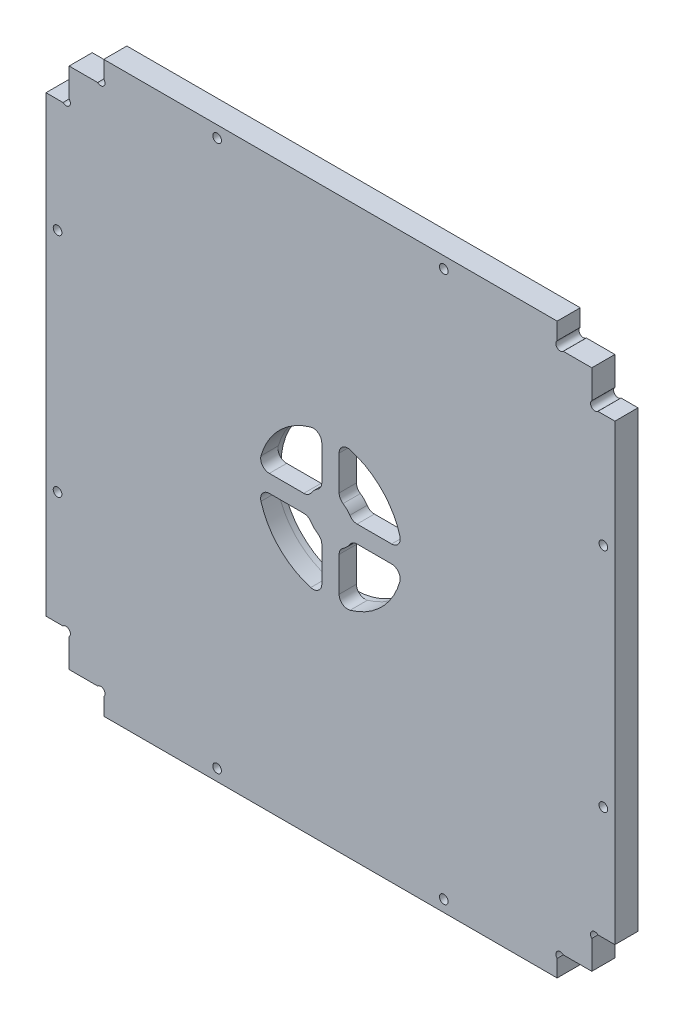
ISO-10303-21;
HEADER;
FILE_DESCRIPTION(('STEP AP214'),'2;1');
FILE_NAME('part.step','',(''),(''),'','','');
FILE_SCHEMA(('AUTOMOTIVE_DESIGN { 1 0 10303 214 1 1 1 1 }'));
ENDSEC;
DATA;
#1=APPLICATION_CONTEXT('core data for automotive mechanical design processes');
#2=APPLICATION_PROTOCOL_DEFINITION('international standard','automotive_design',2000,#1);
#3=PRODUCT_CONTEXT('',#1,'mechanical');
#4=PRODUCT('Part','Part','',(#3));
#5=PRODUCT_RELATED_PRODUCT_CATEGORY('part','',(#4));
#6=PRODUCT_DEFINITION_FORMATION('','',#4);
#7=PRODUCT_DEFINITION_CONTEXT('part definition',#1,'design');
#8=PRODUCT_DEFINITION('design','',#6,#7);
#9=PRODUCT_DEFINITION_SHAPE('','',#8);
#10=(LENGTH_UNIT() NAMED_UNIT(*) SI_UNIT(.MILLI.,.METRE.));
#11=(NAMED_UNIT(*) PLANE_ANGLE_UNIT() SI_UNIT($,.RADIAN.));
#12=(NAMED_UNIT(*) SI_UNIT($,.STERADIAN.) SOLID_ANGLE_UNIT());
#13=UNCERTAINTY_MEASURE_WITH_UNIT(LENGTH_MEASURE(1.E-05),#10,'distance_accuracy_value','');
#14=(GEOMETRIC_REPRESENTATION_CONTEXT(3) GLOBAL_UNCERTAINTY_ASSIGNED_CONTEXT((#13)) GLOBAL_UNIT_ASSIGNED_CONTEXT((#10,
#11,#12)) REPRESENTATION_CONTEXT('',''));
#15=CARTESIAN_POINT('',(0.,0.,0.));
#16=DIRECTION('',(0.,0.,1.));
#17=DIRECTION('',(1.,0.,0.));
#18=AXIS2_PLACEMENT_3D('',#15,#16,#17);
#19=CARTESIAN_POINT('',(-203.531955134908,0.,0.));
#20=DIRECTION('',(-1.,0.,0.));
#21=DIRECTION('',(0.,0.,1.));
#22=AXIS2_PLACEMENT_3D('',#19,#20,#21);
#23=PLANE('',#22);
#24=DIRECTION('',(0.,0.,1.));
#25=VECTOR('',#24,1.);
#26=CARTESIAN_POINT('',(-203.531955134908,-46.8497702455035,0.));
#27=LINE('',#26,#25);
#28=CARTESIAN_POINT('',(-203.531955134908,-46.8497702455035,8.));
#29=VERTEX_POINT('',#28);
#30=CARTESIAN_POINT('',(-203.531955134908,-46.8497702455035,2.));
#31=VERTEX_POINT('',#30);
#32=EDGE_CURVE('E491',#29,#31,#27,.F.);
#33=ORIENTED_EDGE('',*,*,#32,.T.);
#34=DIRECTION('',(0.,-1.,0.));
#35=VECTOR('',#34,1.);
#36=CARTESIAN_POINT('',(-203.531955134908,0.,2.));
#37=LINE('',#36,#35);
#38=CARTESIAN_POINT('',(-203.531955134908,-58.7962362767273,2.));
#39=VERTEX_POINT('',#38);
#40=EDGE_CURVE('E849',#31,#39,#37,.T.);
#41=ORIENTED_EDGE('',*,*,#40,.T.);
#42=DIRECTION('',(0.,0.,-1.));
#43=VECTOR('',#42,1.);
#44=CARTESIAN_POINT('',(-203.531955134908,-58.7962362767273,8.));
#45=LINE('',#44,#43);
#46=CARTESIAN_POINT('',(-203.531955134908,-58.7962362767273,8.));
#47=VERTEX_POINT('',#46);
#48=EDGE_CURVE('E483',#39,#47,#45,.F.);
#49=ORIENTED_EDGE('',*,*,#48,.T.);
#50=DIRECTION('',(0.,-1.,0.));
#51=VECTOR('',#50,1.);
#52=CARTESIAN_POINT('',(-203.531955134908,0.,8.));
#53=LINE('',#52,#51);
#54=EDGE_CURVE('E479',#29,#47,#53,.T.);
#55=ORIENTED_EDGE('',*,*,#54,.F.);
#56=EDGE_LOOP('',(#33,#41,#49,#55));
#57=FACE_BOUND('',#56,.T.);
#58=ADVANCED_FACE('F32',(#57),#23,.T.);
#59=CARTESIAN_POINT('',(-200.531955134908,-68.0157807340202,0.));
#60=DIRECTION('',(0.,0.,1.));
#61=DIRECTION('',(1.,0.,0.));
#62=AXIS2_PLACEMENT_3D('',#59,#60,#61);
#63=CYLINDRICAL_SURFACE('',#62,8.00000000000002);
#64=DIRECTION('',(0.,0.,1.));
#65=VECTOR('',#64,1.);
#66=CARTESIAN_POINT('',(-204.895591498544,-61.3106574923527,0.));
#67=LINE('',#66,#65);
#68=CARTESIAN_POINT('',(-204.895591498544,-61.3106574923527,8.));
#69=VERTEX_POINT('',#68);
#70=CARTESIAN_POINT('',(-204.895591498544,-61.3106574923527,2.));
#71=VERTEX_POINT('',#70);
#72=EDGE_CURVE('E429',#69,#71,#67,.F.);
#73=ORIENTED_EDGE('',*,*,#72,.T.);
#74=CARTESIAN_POINT('',(-200.531955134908,-68.0157807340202,2.));
#75=DIRECTION('',(0.,0.,-1.));
#76=DIRECTION('',(-1.,0.,0.));
#77=AXIS2_PLACEMENT_3D('',#74,#75,#76);
#78=CIRCLE('',#77,8.00000000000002);
#79=CARTESIAN_POINT('',(-207.237078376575,-63.6521443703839,2.));
#80=VERTEX_POINT('',#79);
#81=EDGE_CURVE('E502',#71,#80,#78,.F.);
#82=ORIENTED_EDGE('',*,*,#81,.T.);
#83=DIRECTION('',(0.,0.,1.));
#84=VECTOR('',#83,1.);
#85=CARTESIAN_POINT('',(-207.237078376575,-63.6521443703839,0.));
#86=LINE('',#85,#84);
#87=CARTESIAN_POINT('',(-207.237078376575,-63.6521443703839,8.));
#88=VERTEX_POINT('',#87);
#89=EDGE_CURVE('E434',#80,#88,#86,.T.);
#90=ORIENTED_EDGE('',*,*,#89,.T.);
#91=CARTESIAN_POINT('',(-200.531955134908,-68.0157807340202,8.));
#92=DIRECTION('',(0.,0.,1.));
#93=DIRECTION('',(1.,0.,0.));
#94=AXIS2_PLACEMENT_3D('',#91,#92,#93);
#95=CIRCLE('',#94,8.00000000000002);
#96=EDGE_CURVE('E500',#69,#88,#95,.T.);
#97=ORIENTED_EDGE('',*,*,#96,.F.);
#98=EDGE_LOOP('',(#73,#82,#90,#97));
#99=FACE_BOUND('',#98,.T.);
#100=ADVANCED_FACE('F498',(#99),#63,.T.);
#101=CARTESIAN_POINT('',(0.,-65.0157807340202,0.));
#102=DIRECTION('',(0.,-1.,0.));
#103=DIRECTION('',(0.,0.,-1.));
#104=AXIS2_PLACEMENT_3D('',#101,#102,#103);
#105=PLANE('',#104);
#106=DIRECTION('',(1.,0.,0.));
#107=VECTOR('',#106,1.);
#108=CARTESIAN_POINT('',(0.,-65.0157807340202,2.));
#109=LINE('',#108,#107);
#110=CARTESIAN_POINT('',(-221.697965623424,-65.0157807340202,2.));
#111=VERTEX_POINT('',#110);
#112=CARTESIAN_POINT('',(-209.751499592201,-65.0157807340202,2.));
#113=VERTEX_POINT('',#112);
#114=EDGE_CURVE('E410',#111,#113,#109,.T.);
#115=ORIENTED_EDGE('',*,*,#114,.F.);
#116=DIRECTION('',(0.,0.,-1.));
#117=VECTOR('',#116,1.);
#118=CARTESIAN_POINT('',(-221.697965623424,-65.0157807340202,8.));
#119=LINE('',#118,#117);
#120=CARTESIAN_POINT('',(-221.697965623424,-65.0157807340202,8.));
#121=VERTEX_POINT('',#120);
#122=EDGE_CURVE('E422',#111,#121,#119,.F.);
#123=ORIENTED_EDGE('',*,*,#122,.T.);
#124=DIRECTION('',(1.,0.,0.));
#125=VECTOR('',#124,1.);
#126=CARTESIAN_POINT('',(0.,-65.0157807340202,8.));
#127=LINE('',#126,#125);
#128=CARTESIAN_POINT('',(-209.751499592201,-65.0157807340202,8.));
#129=VERTEX_POINT('',#128);
#130=EDGE_CURVE('E472',#121,#129,#127,.T.);
#131=ORIENTED_EDGE('',*,*,#130,.T.);
#132=DIRECTION('',(0.,0.,1.));
#133=VECTOR('',#132,1.);
#134=CARTESIAN_POINT('',(-209.751499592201,-65.0157807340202,0.));
#135=LINE('',#134,#133);
#136=EDGE_CURVE('E425',#129,#113,#135,.F.);
#137=ORIENTED_EDGE('',*,*,#136,.T.);
#138=EDGE_LOOP('',(#115,#123,#131,#137));
#139=FACE_BOUND('',#138,.T.);
#140=ADVANCED_FACE('F420',(#139),#105,.F.);
#141=CARTESIAN_POINT('',(-200.531955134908,-68.0157807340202,0.));
#142=DIRECTION('',(0.,0.,1.));
#143=DIRECTION('',(1.,0.,0.));
#144=AXIS2_PLACEMENT_3D('',#141,#142,#143);
#145=CYLINDRICAL_SURFACE('',#144,25.);
#146=CARTESIAN_POINT('',(-200.531955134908,-68.0157807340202,2.));
#147=DIRECTION('',(0.,0.,-1.));
#148=DIRECTION('',(-1.,0.,0.));
#149=AXIS2_PLACEMENT_3D('',#146,#147,#148);
#150=CIRCLE('',#149,25.);
#151=CARTESIAN_POINT('',(-207.35013695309,-43.9634960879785,2.));
#152=VERTEX_POINT('',#151);
#153=CARTESIAN_POINT('',(-224.58423978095,-61.1975989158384,2.));
#154=VERTEX_POINT('',#153);
#155=EDGE_CURVE('E413',#152,#154,#150,.F.);
#156=ORIENTED_EDGE('',*,*,#155,.F.);
#157=DIRECTION('',(0.,0.,1.));
#158=VECTOR('',#157,1.);
#159=CARTESIAN_POINT('',(-207.35013695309,-43.9634960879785,0.));
#160=LINE('',#159,#158);
#161=CARTESIAN_POINT('',(-207.35013695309,-43.9634960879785,8.));
#162=VERTEX_POINT('',#161);
#163=EDGE_CURVE('E477',#152,#162,#160,.T.);
#164=ORIENTED_EDGE('',*,*,#163,.T.);
#165=CARTESIAN_POINT('',(-200.531955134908,-68.0157807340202,8.));
#166=DIRECTION('',(0.,0.,1.));
#167=DIRECTION('',(1.,0.,0.));
#168=AXIS2_PLACEMENT_3D('',#165,#166,#167);
#169=CIRCLE('',#168,25.);
#170=CARTESIAN_POINT('',(-224.58423978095,-61.1975989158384,8.));
#171=VERTEX_POINT('',#170);
#172=EDGE_CURVE('E471',#162,#171,#169,.T.);
#173=ORIENTED_EDGE('',*,*,#172,.T.);
#174=DIRECTION('',(0.,0.,1.));
#175=VECTOR('',#174,1.);
#176=CARTESIAN_POINT('',(-224.58423978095,-61.1975989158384,0.));
#177=LINE('',#176,#175);
#178=EDGE_CURVE('E475',#171,#154,#177,.F.);
#179=ORIENTED_EDGE('',*,*,#178,.T.);
#180=EDGE_LOOP('',(#156,#164,#173,#179));
#181=FACE_BOUND('',#180,.T.);
#182=ADVANCED_FACE('F474',(#181),#145,.F.);
#183=CARTESIAN_POINT('',(0.,-65.0157807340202,0.));
#184=DIRECTION('',(0.,-1.,0.));
#185=DIRECTION('',(0.,0.,-1.));
#186=AXIS2_PLACEMENT_3D('',#183,#184,#185);
#187=PLANE('',#186);
#188=DIRECTION('',(1.,0.,0.));
#189=VECTOR('',#188,1.);
#190=CARTESIAN_POINT('',(0.,-65.0157807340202,2.));
#191=LINE('',#190,#189);
#192=CARTESIAN_POINT('',(-191.312410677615,-65.0157807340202,2.));
#193=VERTEX_POINT('',#192);
#194=CARTESIAN_POINT('',(-179.365944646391,-65.0157807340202,2.));
#195=VERTEX_POINT('',#194);
#196=EDGE_CURVE('E868',#193,#195,#191,.T.);
#197=ORIENTED_EDGE('',*,*,#196,.F.);
#198=DIRECTION('',(0.,0.,1.));
#199=VECTOR('',#198,1.);
#200=CARTESIAN_POINT('',(-191.312410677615,-65.0157807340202,0.));
#201=LINE('',#200,#199);
#202=CARTESIAN_POINT('',(-191.312410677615,-65.0157807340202,8.));
#203=VERTEX_POINT('',#202);
#204=EDGE_CURVE('E781',#193,#203,#201,.T.);
#205=ORIENTED_EDGE('',*,*,#204,.T.);
#206=DIRECTION('',(1.,0.,0.));
#207=VECTOR('',#206,1.);
#208=CARTESIAN_POINT('',(0.,-65.0157807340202,8.));
#209=LINE('',#208,#207);
#210=CARTESIAN_POINT('',(-179.365944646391,-65.0157807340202,8.));
#211=VERTEX_POINT('',#210);
#212=EDGE_CURVE('E835',#203,#211,#209,.T.);
#213=ORIENTED_EDGE('',*,*,#212,.T.);
#214=DIRECTION('',(0.,0.,-1.));
#215=VECTOR('',#214,1.);
#216=CARTESIAN_POINT('',(-179.365944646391,-65.0157807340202,0.));
#217=LINE('',#216,#215);
#218=EDGE_CURVE('E783',#211,#195,#217,.T.);
#219=ORIENTED_EDGE('',*,*,#218,.T.);
#220=EDGE_LOOP('',(#197,#205,#213,#219));
#221=FACE_BOUND('',#220,.T.);
#222=ADVANCED_FACE('F933',(#221),#187,.F.);
#223=CARTESIAN_POINT('',(-200.531955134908,-68.0157807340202,0.));
#224=DIRECTION('',(0.,0.,1.));
#225=DIRECTION('',(1.,0.,0.));
#226=AXIS2_PLACEMENT_3D('',#223,#224,#225);
#227=CYLINDRICAL_SURFACE('',#226,8.00000000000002);
#228=DIRECTION('',(0.,0.,1.));
#229=VECTOR('',#228,1.);
#230=CARTESIAN_POINT('',(-193.82683189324,-63.6521443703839,0.));
#231=LINE('',#230,#229);
#232=CARTESIAN_POINT('',(-193.82683189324,-63.6521443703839,8.));
#233=VERTEX_POINT('',#232);
#234=CARTESIAN_POINT('',(-193.82683189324,-63.6521443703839,2.));
#235=VERTEX_POINT('',#234);
#236=EDGE_CURVE('E808',#233,#235,#231,.F.);
#237=ORIENTED_EDGE('',*,*,#236,.T.);
#238=CARTESIAN_POINT('',(-200.531955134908,-68.0157807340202,2.));
#239=DIRECTION('',(0.,0.,-1.));
#240=DIRECTION('',(-1.,0.,0.));
#241=AXIS2_PLACEMENT_3D('',#238,#239,#240);
#242=CIRCLE('',#241,8.00000000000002);
#243=CARTESIAN_POINT('',(-196.168318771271,-61.3106574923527,2.));
#244=VERTEX_POINT('',#243);
#245=EDGE_CURVE('E865',#235,#244,#242,.F.);
#246=ORIENTED_EDGE('',*,*,#245,.T.);
#247=DIRECTION('',(0.,0.,1.));
#248=VECTOR('',#247,1.);
#249=CARTESIAN_POINT('',(-196.168318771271,-61.3106574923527,0.));
#250=LINE('',#249,#248);
#251=CARTESIAN_POINT('',(-196.168318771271,-61.3106574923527,8.));
#252=VERTEX_POINT('',#251);
#253=EDGE_CURVE('E806',#244,#252,#250,.T.);
#254=ORIENTED_EDGE('',*,*,#253,.T.);
#255=CARTESIAN_POINT('',(-200.531955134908,-68.0157807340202,8.));
#256=DIRECTION('',(0.,0.,1.));
#257=DIRECTION('',(1.,0.,0.));
#258=AXIS2_PLACEMENT_3D('',#255,#256,#257);
#259=CIRCLE('',#258,8.00000000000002);
#260=EDGE_CURVE('E831',#233,#252,#259,.T.);
#261=ORIENTED_EDGE('',*,*,#260,.F.);
#262=EDGE_LOOP('',(#237,#246,#254,#261));
#263=FACE_BOUND('',#262,.T.);
#264=ADVANCED_FACE('F955',(#263),#227,.T.);
#265=CARTESIAN_POINT('',(-197.531955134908,-3.15035697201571E-13,0.));
#266=DIRECTION('',(-1.,0.,0.));
#267=DIRECTION('',(0.,-1.,0.));
#268=AXIS2_PLACEMENT_3D('',#265,#266,#267);
#269=PLANE('',#268);
#270=DIRECTION('',(0.,-1.,0.));
#271=VECTOR('',#270,1.);
#272=CARTESIAN_POINT('',(-197.531955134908,-3.15035697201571E-13,2.));
#273=LINE('',#272,#271);
#274=CARTESIAN_POINT('',(-197.531955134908,-46.8497702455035,2.));
#275=VERTEX_POINT('',#274);
#276=CARTESIAN_POINT('',(-197.531955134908,-58.7962362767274,2.));
#277=VERTEX_POINT('',#276);
#278=EDGE_CURVE('E819',#275,#277,#273,.T.);
#279=ORIENTED_EDGE('',*,*,#278,.F.);
#280=DIRECTION('',(0.,0.,-1.));
#281=VECTOR('',#280,1.);
#282=CARTESIAN_POINT('',(-197.531955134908,-46.8497702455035,8.));
#283=LINE('',#282,#281);
#284=CARTESIAN_POINT('',(-197.531955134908,-46.8497702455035,8.));
#285=VERTEX_POINT('',#284);
#286=EDGE_CURVE('E486',#275,#285,#283,.F.);
#287=ORIENTED_EDGE('',*,*,#286,.T.);
#288=DIRECTION('',(0.,-1.,0.));
#289=VECTOR('',#288,1.);
#290=CARTESIAN_POINT('',(-197.531955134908,-3.15035697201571E-13,8.));
#291=LINE('',#290,#289);
#292=CARTESIAN_POINT('',(-197.531955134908,-58.7962362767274,8.));
#293=VERTEX_POINT('',#292);
#294=EDGE_CURVE('E817',#285,#293,#291,.T.);
#295=ORIENTED_EDGE('',*,*,#294,.T.);
#296=DIRECTION('',(0.,0.,1.));
#297=VECTOR('',#296,1.);
#298=CARTESIAN_POINT('',(-197.531955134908,-58.7962362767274,0.));
#299=LINE('',#298,#297);
#300=EDGE_CURVE('E481',#293,#277,#299,.F.);
#301=ORIENTED_EDGE('',*,*,#300,.T.);
#302=EDGE_LOOP('',(#279,#287,#295,#301));
#303=FACE_BOUND('',#302,.T.);
#304=ADVANCED_FACE('F815',(#303),#269,.F.);
#305=CARTESIAN_POINT('',(-200.531955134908,-68.0157807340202,0.));
#306=DIRECTION('',(0.,0.,1.));
#307=DIRECTION('',(1.,0.,0.));
#308=AXIS2_PLACEMENT_3D('',#305,#306,#307);
#309=CYLINDRICAL_SURFACE('',#308,25.);
#310=CARTESIAN_POINT('',(-200.531955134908,-68.0157807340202,2.));
#311=DIRECTION('',(0.,0.,-1.));
#312=DIRECTION('',(-1.,0.,0.));
#313=AXIS2_PLACEMENT_3D('',#310,#311,#312);
#314=CIRCLE('',#313,25.);
#315=CARTESIAN_POINT('',(-176.479670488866,-61.1975989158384,2.));
#316=VERTEX_POINT('',#315);
#317=CARTESIAN_POINT('',(-193.713773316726,-43.9634960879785,2.));
#318=VERTEX_POINT('',#317);
#319=EDGE_CURVE('E858',#316,#318,#314,.F.);
#320=ORIENTED_EDGE('',*,*,#319,.F.);
#321=DIRECTION('',(0.,0.,1.));
#322=VECTOR('',#321,1.);
#323=CARTESIAN_POINT('',(-176.479670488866,-61.1975989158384,0.));
#324=LINE('',#323,#322);
#325=CARTESIAN_POINT('',(-176.479670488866,-61.1975989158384,8.));
#326=VERTEX_POINT('',#325);
#327=EDGE_CURVE('E779',#316,#326,#324,.T.);
#328=ORIENTED_EDGE('',*,*,#327,.T.);
#329=CARTESIAN_POINT('',(-200.531955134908,-68.0157807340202,8.));
#330=DIRECTION('',(0.,0.,1.));
#331=DIRECTION('',(1.,0.,0.));
#332=AXIS2_PLACEMENT_3D('',#329,#330,#331);
#333=CIRCLE('',#332,25.);
#334=CARTESIAN_POINT('',(-193.713773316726,-43.9634960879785,8.));
#335=VERTEX_POINT('',#334);
#336=EDGE_CURVE('E832',#326,#335,#333,.T.);
#337=ORIENTED_EDGE('',*,*,#336,.T.);
#338=DIRECTION('',(0.,0.,1.));
#339=VECTOR('',#338,1.);
#340=CARTESIAN_POINT('',(-193.713773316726,-43.9634960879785,0.));
#341=LINE('',#340,#339);
#342=EDGE_CURVE('E776',#335,#318,#341,.F.);
#343=ORIENTED_EDGE('',*,*,#342,.T.);
#344=EDGE_LOOP('',(#320,#328,#337,#343));
#345=FACE_BOUND('',#344,.T.);
#346=ADVANCED_FACE('F944',(#345),#309,.F.);
#347=CARTESIAN_POINT('',(-197.531955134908,0.,0.));
#348=DIRECTION('',(-1.,0.,0.));
#349=DIRECTION('',(0.,0.,1.));
#350=AXIS2_PLACEMENT_3D('',#347,#348,#349);
#351=PLANE('',#350);
#352=DIRECTION('',(0.,-1.,0.));
#353=VECTOR('',#352,1.);
#354=CARTESIAN_POINT('',(-197.531955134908,0.,2.));
#355=LINE('',#354,#353);
#356=CARTESIAN_POINT('',(-197.531955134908,-77.2353251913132,2.));
#357=VERTEX_POINT('',#356);
#358=CARTESIAN_POINT('',(-197.531955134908,-89.181791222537,2.));
#359=VERTEX_POINT('',#358);
#360=EDGE_CURVE('E55',#357,#359,#355,.T.);
#361=ORIENTED_EDGE('',*,*,#360,.F.);
#362=DIRECTION('',(0.,0.,1.));
#363=VECTOR('',#362,1.);
#364=CARTESIAN_POINT('',(-197.531955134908,-77.2353251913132,0.));
#365=LINE('',#364,#363);
#366=CARTESIAN_POINT('',(-197.531955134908,-77.2353251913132,8.));
#367=VERTEX_POINT('',#366);
#368=EDGE_CURVE('E799',#357,#367,#365,.T.);
#369=ORIENTED_EDGE('',*,*,#368,.T.);
#370=DIRECTION('',(0.,-1.,0.));
#371=VECTOR('',#370,1.);
#372=CARTESIAN_POINT('',(-197.531955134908,0.,8.));
#373=LINE('',#372,#371);
#374=CARTESIAN_POINT('',(-197.531955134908,-89.181791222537,8.));
#375=VERTEX_POINT('',#374);
#376=EDGE_CURVE('E918',#367,#375,#373,.T.);
#377=ORIENTED_EDGE('',*,*,#376,.T.);
#378=DIRECTION('',(0.,0.,-1.));
#379=VECTOR('',#378,1.);
#380=CARTESIAN_POINT('',(-197.531955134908,-89.181791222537,0.));
#381=LINE('',#380,#379);
#382=EDGE_CURVE('E796',#375,#359,#381,.T.);
#383=ORIENTED_EDGE('',*,*,#382,.T.);
#384=EDGE_LOOP('',(#361,#369,#377,#383));
#385=FACE_BOUND('',#384,.T.);
#386=ADVANCED_FACE('F946',(#385),#351,.F.);
#387=CARTESIAN_POINT('',(-200.531955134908,-68.0157807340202,0.));
#388=DIRECTION('',(0.,0.,1.));
#389=DIRECTION('',(1.,0.,0.));
#390=AXIS2_PLACEMENT_3D('',#387,#388,#389);
#391=CYLINDRICAL_SURFACE('',#390,8.00000000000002);
#392=DIRECTION('',(0.,0.,1.));
#393=VECTOR('',#392,1.);
#394=CARTESIAN_POINT('',(-196.168318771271,-74.7209039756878,0.));
#395=LINE('',#394,#393);
#396=CARTESIAN_POINT('',(-196.168318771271,-74.7209039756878,8.));
#397=VERTEX_POINT('',#396);
#398=CARTESIAN_POINT('',(-196.168318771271,-74.7209039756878,2.));
#399=VERTEX_POINT('',#398);
#400=EDGE_CURVE('E803',#397,#399,#395,.F.);
#401=ORIENTED_EDGE('',*,*,#400,.T.);
#402=CARTESIAN_POINT('',(-200.531955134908,-68.0157807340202,2.));
#403=DIRECTION('',(0.,0.,-1.));
#404=DIRECTION('',(-1.,0.,0.));
#405=AXIS2_PLACEMENT_3D('',#402,#403,#404);
#406=CIRCLE('',#405,8.00000000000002);
#407=CARTESIAN_POINT('',(-193.82683189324,-72.3794170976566,2.));
#408=VERTEX_POINT('',#407);
#409=EDGE_CURVE('E884',#399,#408,#406,.F.);
#410=ORIENTED_EDGE('',*,*,#409,.T.);
#411=DIRECTION('',(0.,0.,1.));
#412=VECTOR('',#411,1.);
#413=CARTESIAN_POINT('',(-193.82683189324,-72.3794170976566,0.));
#414=LINE('',#413,#412);
#415=CARTESIAN_POINT('',(-193.82683189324,-72.3794170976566,8.));
#416=VERTEX_POINT('',#415);
#417=EDGE_CURVE('E801',#408,#416,#414,.T.);
#418=ORIENTED_EDGE('',*,*,#417,.T.);
#419=CARTESIAN_POINT('',(-200.531955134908,-68.0157807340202,8.));
#420=DIRECTION('',(0.,0.,1.));
#421=DIRECTION('',(1.,0.,0.));
#422=AXIS2_PLACEMENT_3D('',#419,#420,#421);
#423=CIRCLE('',#422,8.00000000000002);
#424=EDGE_CURVE('E927',#397,#416,#423,.T.);
#425=ORIENTED_EDGE('',*,*,#424,.F.);
#426=EDGE_LOOP('',(#401,#410,#418,#425));
#427=FACE_BOUND('',#426,.T.);
#428=ADVANCED_FACE('F952',(#427),#391,.T.);
#429=CARTESIAN_POINT('',(0.,-71.0157807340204,0.));
#430=DIRECTION('',(0.,-1.,0.));
#431=DIRECTION('',(1.,0.,0.));
#432=AXIS2_PLACEMENT_3D('',#429,#430,#431);
#433=PLANE('',#432);
#434=DIRECTION('',(0.,0.,-1.));
#435=VECTOR('',#434,1.);
#436=CARTESIAN_POINT('',(-191.312410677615,-71.0157807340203,0.));
#437=LINE('',#436,#435);
#438=CARTESIAN_POINT('',(-191.312410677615,-71.0157807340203,8.));
#439=VERTEX_POINT('',#438);
#440=CARTESIAN_POINT('',(-191.312410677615,-71.0157807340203,2.));
#441=VERTEX_POINT('',#440);
#442=EDGE_CURVE('E766',#439,#441,#437,.T.);
#443=ORIENTED_EDGE('',*,*,#442,.T.);
#444=DIRECTION('',(1.,0.,0.));
#445=VECTOR('',#444,1.);
#446=CARTESIAN_POINT('',(0.,-71.0157807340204,2.));
#447=LINE('',#446,#445);
#448=CARTESIAN_POINT('',(-179.365944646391,-71.0157807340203,2.));
#449=VERTEX_POINT('',#448);
#450=EDGE_CURVE('E881',#441,#449,#447,.T.);
#451=ORIENTED_EDGE('',*,*,#450,.T.);
#452=DIRECTION('',(0.,0.,1.));
#453=VECTOR('',#452,1.);
#454=CARTESIAN_POINT('',(-179.365944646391,-71.0157807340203,0.));
#455=LINE('',#454,#453);
#456=CARTESIAN_POINT('',(-179.365944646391,-71.0157807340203,8.));
#457=VERTEX_POINT('',#456);
#458=EDGE_CURVE('E769',#449,#457,#455,.T.);
#459=ORIENTED_EDGE('',*,*,#458,.T.);
#460=DIRECTION('',(1.,0.,0.));
#461=VECTOR('',#460,1.);
#462=CARTESIAN_POINT('',(0.,-71.0157807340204,8.));
#463=LINE('',#462,#461);
#464=EDGE_CURVE('E924',#439,#457,#463,.T.);
#465=ORIENTED_EDGE('',*,*,#464,.F.);
#466=EDGE_LOOP('',(#443,#451,#459,#465));
#467=FACE_BOUND('',#466,.T.);
#468=ADVANCED_FACE('F1492',(#467),#433,.T.);
#469=CARTESIAN_POINT('',(-200.531955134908,-68.0157807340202,0.));
#470=DIRECTION('',(0.,0.,1.));
#471=DIRECTION('',(1.,0.,0.));
#472=AXIS2_PLACEMENT_3D('',#469,#470,#471);
#473=CYLINDRICAL_SURFACE('',#472,25.);
#474=CARTESIAN_POINT('',(-200.531955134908,-68.0157807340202,2.));
#475=DIRECTION('',(0.,0.,-1.));
#476=DIRECTION('',(-1.,0.,0.));
#477=AXIS2_PLACEMENT_3D('',#474,#475,#476);
#478=CIRCLE('',#477,25.);
#479=CARTESIAN_POINT('',(-193.713773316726,-92.068065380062,2.));
#480=VERTEX_POINT('',#479);
#481=CARTESIAN_POINT('',(-176.479670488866,-74.8339625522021,2.));
#482=VERTEX_POINT('',#481);
#483=EDGE_CURVE('E874',#480,#482,#478,.F.);
#484=ORIENTED_EDGE('',*,*,#483,.F.);
#485=DIRECTION('',(0.,0.,1.));
#486=VECTOR('',#485,1.);
#487=CARTESIAN_POINT('',(-193.713773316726,-92.068065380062,0.));
#488=LINE('',#487,#486);
#489=CARTESIAN_POINT('',(-193.713773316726,-92.068065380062,8.));
#490=VERTEX_POINT('',#489);
#491=EDGE_CURVE('E771',#480,#490,#488,.T.);
#492=ORIENTED_EDGE('',*,*,#491,.T.);
#493=CARTESIAN_POINT('',(-200.531955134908,-68.0157807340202,8.));
#494=DIRECTION('',(0.,0.,1.));
#495=DIRECTION('',(1.,0.,0.));
#496=AXIS2_PLACEMENT_3D('',#493,#494,#495);
#497=CIRCLE('',#496,25.);
#498=CARTESIAN_POINT('',(-176.479670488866,-74.8339625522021,8.));
#499=VERTEX_POINT('',#498);
#500=EDGE_CURVE('E921',#490,#499,#497,.T.);
#501=ORIENTED_EDGE('',*,*,#500,.T.);
#502=DIRECTION('',(0.,0.,1.));
#503=VECTOR('',#502,1.);
#504=CARTESIAN_POINT('',(-176.479670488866,-74.8339625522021,0.));
#505=LINE('',#504,#503);
#506=EDGE_CURVE('E773',#499,#482,#505,.F.);
#507=ORIENTED_EDGE('',*,*,#506,.T.);
#508=EDGE_LOOP('',(#484,#492,#501,#507));
#509=FACE_BOUND('',#508,.T.);
#510=ADVANCED_FACE('F1501',(#509),#473,.F.);
#511=CARTESIAN_POINT('',(-200.531955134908,-68.0157807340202,0.));
#512=DIRECTION('',(0.,0.,1.));
#513=DIRECTION('',(1.,0.,0.));
#514=AXIS2_PLACEMENT_3D('',#511,#512,#513);
#515=CYLINDRICAL_SURFACE('',#514,8.00000000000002);
#516=DIRECTION('',(0.,0.,1.));
#517=VECTOR('',#516,1.);
#518=CARTESIAN_POINT('',(-207.237078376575,-72.3794170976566,0.));
#519=LINE('',#518,#517);
#520=CARTESIAN_POINT('',(-207.237078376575,-72.3794170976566,8.));
#521=VERTEX_POINT('',#520);
#522=CARTESIAN_POINT('',(-207.237078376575,-72.3794170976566,2.));
#523=VERTEX_POINT('',#522);
#524=EDGE_CURVE('E786',#521,#523,#519,.F.);
#525=ORIENTED_EDGE('',*,*,#524,.T.);
#526=CARTESIAN_POINT('',(-200.531955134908,-68.0157807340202,2.));
#527=DIRECTION('',(0.,0.,-1.));
#528=DIRECTION('',(-1.,0.,0.));
#529=AXIS2_PLACEMENT_3D('',#526,#527,#528);
#530=CIRCLE('',#529,8.00000000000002);
#531=CARTESIAN_POINT('',(-204.895591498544,-74.7209039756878,2.));
#532=VERTEX_POINT('',#531);
#533=EDGE_CURVE('E901',#523,#532,#530,.F.);
#534=ORIENTED_EDGE('',*,*,#533,.T.);
#535=DIRECTION('',(0.,0.,1.));
#536=VECTOR('',#535,1.);
#537=CARTESIAN_POINT('',(-204.895591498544,-74.7209039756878,0.));
#538=LINE('',#537,#536);
#539=CARTESIAN_POINT('',(-204.895591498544,-74.7209039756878,8.));
#540=VERTEX_POINT('',#539);
#541=EDGE_CURVE('E789',#532,#540,#538,.T.);
#542=ORIENTED_EDGE('',*,*,#541,.T.);
#543=CARTESIAN_POINT('',(-200.531955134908,-68.0157807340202,8.));
#544=DIRECTION('',(0.,0.,1.));
#545=DIRECTION('',(1.,0.,0.));
#546=AXIS2_PLACEMENT_3D('',#543,#544,#545);
#547=CIRCLE('',#546,8.00000000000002);
#548=EDGE_CURVE('E906',#521,#540,#547,.T.);
#549=ORIENTED_EDGE('',*,*,#548,.F.);
#550=EDGE_LOOP('',(#525,#534,#542,#549));
#551=FACE_BOUND('',#550,.T.);
#552=ADVANCED_FACE('F1510',(#551),#515,.T.);
#553=CARTESIAN_POINT('',(-203.531955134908,0.,0.));
#554=DIRECTION('',(-1.,0.,0.));
#555=DIRECTION('',(0.,0.,1.));
#556=AXIS2_PLACEMENT_3D('',#553,#554,#555);
#557=PLANE('',#556);
#558=DIRECTION('',(0.,0.,-1.));
#559=VECTOR('',#558,1.);
#560=CARTESIAN_POINT('',(-203.531955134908,-77.2353251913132,0.));
#561=LINE('',#560,#559);
#562=CARTESIAN_POINT('',(-203.531955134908,-77.2353251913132,8.));
#563=VERTEX_POINT('',#562);
#564=CARTESIAN_POINT('',(-203.531955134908,-77.2353251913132,2.));
#565=VERTEX_POINT('',#564);
#566=EDGE_CURVE('E756',#563,#565,#561,.T.);
#567=ORIENTED_EDGE('',*,*,#566,.T.);
#568=DIRECTION('',(0.,-1.,0.));
#569=VECTOR('',#568,1.);
#570=CARTESIAN_POINT('',(-203.531955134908,0.,2.));
#571=LINE('',#570,#569);
#572=CARTESIAN_POINT('',(-203.531955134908,-89.181791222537,2.));
#573=VERTEX_POINT('',#572);
#574=EDGE_CURVE('E898',#565,#573,#571,.T.);
#575=ORIENTED_EDGE('',*,*,#574,.T.);
#576=DIRECTION('',(0.,0.,1.));
#577=VECTOR('',#576,1.);
#578=CARTESIAN_POINT('',(-203.531955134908,-89.181791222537,0.));
#579=LINE('',#578,#577);
#580=CARTESIAN_POINT('',(-203.531955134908,-89.181791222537,8.));
#581=VERTEX_POINT('',#580);
#582=EDGE_CURVE('E759',#573,#581,#579,.T.);
#583=ORIENTED_EDGE('',*,*,#582,.T.);
#584=DIRECTION('',(0.,-1.,0.));
#585=VECTOR('',#584,1.);
#586=CARTESIAN_POINT('',(-203.531955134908,0.,8.));
#587=LINE('',#586,#585);
#588=EDGE_CURVE('E915',#563,#581,#587,.T.);
#589=ORIENTED_EDGE('',*,*,#588,.F.);
#590=EDGE_LOOP('',(#567,#575,#583,#589));
#591=FACE_BOUND('',#590,.T.);
#592=ADVANCED_FACE('F1519',(#591),#557,.T.);
#593=CARTESIAN_POINT('',(-200.531955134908,-68.0157807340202,0.));
#594=DIRECTION('',(0.,0.,1.));
#595=DIRECTION('',(1.,0.,0.));
#596=AXIS2_PLACEMENT_3D('',#593,#594,#595);
#597=CYLINDRICAL_SURFACE('',#596,25.);
#598=CARTESIAN_POINT('',(-200.531955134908,-68.0157807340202,2.));
#599=DIRECTION('',(0.,0.,-1.));
#600=DIRECTION('',(-1.,0.,0.));
#601=AXIS2_PLACEMENT_3D('',#598,#599,#600);
#602=CIRCLE('',#601,25.);
#603=CARTESIAN_POINT('',(-224.58423978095,-74.8339625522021,2.));
#604=VERTEX_POINT('',#603);
#605=CARTESIAN_POINT('',(-207.35013695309,-92.068065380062,2.));
#606=VERTEX_POINT('',#605);
#607=EDGE_CURVE('E892',#604,#606,#602,.F.);
#608=ORIENTED_EDGE('',*,*,#607,.F.);
#609=DIRECTION('',(0.,0.,1.));
#610=VECTOR('',#609,1.);
#611=CARTESIAN_POINT('',(-224.58423978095,-74.8339625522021,0.));
#612=LINE('',#611,#610);
#613=CARTESIAN_POINT('',(-224.58423978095,-74.8339625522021,8.));
#614=VERTEX_POINT('',#613);
#615=EDGE_CURVE('E761',#604,#614,#612,.T.);
#616=ORIENTED_EDGE('',*,*,#615,.T.);
#617=CARTESIAN_POINT('',(-200.531955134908,-68.0157807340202,8.));
#618=DIRECTION('',(0.,0.,1.));
#619=DIRECTION('',(1.,0.,0.));
#620=AXIS2_PLACEMENT_3D('',#617,#618,#619);
#621=CIRCLE('',#620,25.);
#622=CARTESIAN_POINT('',(-207.35013695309,-92.068065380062,8.));
#623=VERTEX_POINT('',#622);
#624=EDGE_CURVE('E912',#614,#623,#621,.T.);
#625=ORIENTED_EDGE('',*,*,#624,.T.);
#626=DIRECTION('',(0.,0.,1.));
#627=VECTOR('',#626,1.);
#628=CARTESIAN_POINT('',(-207.35013695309,-92.068065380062,0.));
#629=LINE('',#628,#627);
#630=EDGE_CURVE('E763',#623,#606,#629,.F.);
#631=ORIENTED_EDGE('',*,*,#630,.T.);
#632=EDGE_LOOP('',(#608,#616,#625,#631));
#633=FACE_BOUND('',#632,.T.);
#634=ADVANCED_FACE('F1528',(#633),#597,.F.);
#635=CARTESIAN_POINT('',(0.,-71.0157807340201,0.));
#636=DIRECTION('',(0.,-1.,0.));
#637=DIRECTION('',(1.,0.,0.));
#638=AXIS2_PLACEMENT_3D('',#635,#636,#637);
#639=PLANE('',#638);
#640=DIRECTION('',(0.,0.,1.));
#641=VECTOR('',#640,1.);
#642=CARTESIAN_POINT('',(-221.697965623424,-71.0157807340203,0.));
#643=LINE('',#642,#641);
#644=CARTESIAN_POINT('',(-221.697965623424,-71.0157807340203,8.));
#645=VERTEX_POINT('',#644);
#646=CARTESIAN_POINT('',(-221.697965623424,-71.0157807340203,2.));
#647=VERTEX_POINT('',#646);
#648=EDGE_CURVE('E791',#645,#647,#643,.F.);
#649=ORIENTED_EDGE('',*,*,#648,.T.);
#650=DIRECTION('',(1.,0.,0.));
#651=VECTOR('',#650,1.);
#652=CARTESIAN_POINT('',(0.,-71.0157807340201,2.));
#653=LINE('',#652,#651);
#654=CARTESIAN_POINT('',(-209.751499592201,-71.0157807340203,2.));
#655=VERTEX_POINT('',#654);
#656=EDGE_CURVE('E47',#647,#655,#653,.T.);
#657=ORIENTED_EDGE('',*,*,#656,.T.);
#658=DIRECTION('',(0.,0.,-1.));
#659=VECTOR('',#658,1.);
#660=CARTESIAN_POINT('',(-209.751499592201,-71.0157807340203,8.));
#661=LINE('',#660,#659);
#662=CARTESIAN_POINT('',(-209.751499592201,-71.0157807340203,8.));
#663=VERTEX_POINT('',#662);
#664=EDGE_CURVE('E794',#655,#663,#661,.F.);
#665=ORIENTED_EDGE('',*,*,#664,.T.);
#666=DIRECTION('',(1.,0.,0.));
#667=VECTOR('',#666,1.);
#668=CARTESIAN_POINT('',(0.,-71.0157807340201,8.));
#669=LINE('',#668,#667);
#670=EDGE_CURVE('E909',#645,#663,#669,.T.);
#671=ORIENTED_EDGE('',*,*,#670,.F.);
#672=EDGE_LOOP('',(#649,#657,#665,#671));
#673=FACE_BOUND('',#672,.T.);
#674=ADVANCED_FACE('F1121',(#673),#639,.T.);
#675=CARTESIAN_POINT('',(-206.531955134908,-89.181791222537,0.));
#676=DIRECTION('',(0.,0.,1.));
#677=DIRECTION('',(1.,0.,0.));
#678=AXIS2_PLACEMENT_3D('',#675,#676,#677);
#679=CYLINDRICAL_SURFACE('',#678,3.);
#680=CARTESIAN_POINT('',(-206.531955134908,-89.181791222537,2.));
#681=DIRECTION('',(0.,0.,-1.));
#682=DIRECTION('',(-1.,0.,0.));
#683=AXIS2_PLACEMENT_3D('',#680,#681,#682);
#684=CIRCLE('',#683,3.);
#685=EDGE_CURVE('E896',#606,#573,#684,.F.);
#686=ORIENTED_EDGE('',*,*,#685,.F.);
#687=ORIENTED_EDGE('',*,*,#630,.F.);
#688=CARTESIAN_POINT('',(-206.531955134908,-89.181791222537,8.));
#689=DIRECTION('',(0.,0.,1.));
#690=DIRECTION('',(1.,0.,0.));
#691=AXIS2_PLACEMENT_3D('',#688,#689,#690);
#692=CIRCLE('',#691,3.);
#693=EDGE_CURVE('E431',#581,#623,#692,.F.);
#694=ORIENTED_EDGE('',*,*,#693,.F.);
#695=ORIENTED_EDGE('',*,*,#582,.F.);
#696=EDGE_LOOP('',(#686,#687,#694,#695));
#697=FACE_BOUND('',#696,.T.);
#698=ADVANCED_FACE('F1117',(#697),#679,.F.);
#699=CARTESIAN_POINT('',(-179.365944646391,-74.0157807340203,0.));
#700=DIRECTION('',(0.,0.,1.));
#701=DIRECTION('',(1.,0.,0.));
#702=AXIS2_PLACEMENT_3D('',#699,#700,#701);
#703=CYLINDRICAL_SURFACE('',#702,3.);
#704=CARTESIAN_POINT('',(-179.365944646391,-74.0157807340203,2.));
#705=DIRECTION('',(0.,0.,-1.));
#706=DIRECTION('',(-1.,0.,0.));
#707=AXIS2_PLACEMENT_3D('',#704,#705,#706);
#708=CIRCLE('',#707,3.);
#709=EDGE_CURVE('E879',#482,#449,#708,.F.);
#710=ORIENTED_EDGE('',*,*,#709,.F.);
#711=ORIENTED_EDGE('',*,*,#506,.F.);
#712=CARTESIAN_POINT('',(-179.365944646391,-74.0157807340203,8.));
#713=DIRECTION('',(0.,0.,1.));
#714=DIRECTION('',(1.,0.,0.));
#715=AXIS2_PLACEMENT_3D('',#712,#713,#714);
#716=CIRCLE('',#715,3.);
#717=EDGE_CURVE('E439',#457,#499,#716,.F.);
#718=ORIENTED_EDGE('',*,*,#717,.F.);
#719=ORIENTED_EDGE('',*,*,#458,.F.);
#720=EDGE_LOOP('',(#710,#711,#718,#719));
#721=FACE_BOUND('',#720,.T.);
#722=ADVANCED_FACE('F1120',(#721),#703,.F.);
#723=CARTESIAN_POINT('',(-179.365944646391,-62.0157807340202,0.));
#724=DIRECTION('',(0.,0.,1.));
#725=DIRECTION('',(1.,0.,0.));
#726=AXIS2_PLACEMENT_3D('',#723,#724,#725);
#727=CYLINDRICAL_SURFACE('',#726,3.);
#728=CARTESIAN_POINT('',(-179.365944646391,-62.0157807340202,2.));
#729=DIRECTION('',(0.,0.,-1.));
#730=DIRECTION('',(-1.,0.,0.));
#731=AXIS2_PLACEMENT_3D('',#728,#729,#730);
#732=CIRCLE('',#731,3.);
#733=EDGE_CURVE('E863',#195,#316,#732,.F.);
#734=ORIENTED_EDGE('',*,*,#733,.F.);
#735=ORIENTED_EDGE('',*,*,#218,.F.);
#736=CARTESIAN_POINT('',(-179.365944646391,-62.0157807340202,8.));
#737=DIRECTION('',(0.,0.,1.));
#738=DIRECTION('',(1.,0.,0.));
#739=AXIS2_PLACEMENT_3D('',#736,#737,#738);
#740=CIRCLE('',#739,3.);
#741=EDGE_CURVE('E441',#326,#211,#740,.F.);
#742=ORIENTED_EDGE('',*,*,#741,.F.);
#743=ORIENTED_EDGE('',*,*,#327,.F.);
#744=EDGE_LOOP('',(#734,#735,#742,#743));
#745=FACE_BOUND('',#744,.T.);
#746=ADVANCED_FACE('F939',(#745),#727,.F.);
#747=CARTESIAN_POINT('',(-206.531955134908,-77.2353251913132,0.));
#748=DIRECTION('',(0.,0.,1.));
#749=DIRECTION('',(1.,0.,0.));
#750=AXIS2_PLACEMENT_3D('',#747,#748,#749);
#751=CYLINDRICAL_SURFACE('',#750,3.);
#752=CARTESIAN_POINT('',(-206.531955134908,-77.2353251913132,2.));
#753=DIRECTION('',(0.,0.,-1.));
#754=DIRECTION('',(-1.,0.,0.));
#755=AXIS2_PLACEMENT_3D('',#752,#753,#754);
#756=CIRCLE('',#755,3.);
#757=EDGE_CURVE('E904',#565,#532,#756,.F.);
#758=ORIENTED_EDGE('',*,*,#757,.F.);
#759=ORIENTED_EDGE('',*,*,#566,.F.);
#760=CARTESIAN_POINT('',(-206.531955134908,-77.2353251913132,8.));
#761=DIRECTION('',(0.,0.,1.));
#762=DIRECTION('',(1.,0.,0.));
#763=AXIS2_PLACEMENT_3D('',#760,#761,#762);
#764=CIRCLE('',#763,3.);
#765=EDGE_CURVE('E443',#540,#563,#764,.F.);
#766=ORIENTED_EDGE('',*,*,#765,.F.);
#767=ORIENTED_EDGE('',*,*,#541,.F.);
#768=EDGE_LOOP('',(#758,#759,#766,#767));
#769=FACE_BOUND('',#768,.T.);
#770=ADVANCED_FACE('F1128',(#769),#751,.F.);
#771=CARTESIAN_POINT('',(-209.751499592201,-74.0157807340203,0.));
#772=DIRECTION('',(0.,0.,1.));
#773=DIRECTION('',(1.,0.,0.));
#774=AXIS2_PLACEMENT_3D('',#771,#772,#773);
#775=CYLINDRICAL_SURFACE('',#774,3.);
#776=CARTESIAN_POINT('',(-209.751499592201,-74.0157807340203,2.));
#777=DIRECTION('',(0.,0.,-1.));
#778=DIRECTION('',(-1.,0.,0.));
#779=AXIS2_PLACEMENT_3D('',#776,#777,#778);
#780=CIRCLE('',#779,3.);
#781=EDGE_CURVE('E894',#523,#655,#780,.F.);
#782=ORIENTED_EDGE('',*,*,#781,.F.);
#783=ORIENTED_EDGE('',*,*,#524,.F.);
#784=CARTESIAN_POINT('',(-209.751499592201,-74.0157807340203,8.));
#785=DIRECTION('',(0.,0.,1.));
#786=DIRECTION('',(1.,0.,0.));
#787=AXIS2_PLACEMENT_3D('',#784,#785,#786);
#788=CIRCLE('',#787,3.);
#789=EDGE_CURVE('E445',#663,#521,#788,.F.);
#790=ORIENTED_EDGE('',*,*,#789,.F.);
#791=ORIENTED_EDGE('',*,*,#664,.F.);
#792=EDGE_LOOP('',(#782,#783,#790,#791));
#793=FACE_BOUND('',#792,.T.);
#794=ADVANCED_FACE('F1131',(#793),#775,.F.);
#795=CARTESIAN_POINT('',(-221.697965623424,-74.0157807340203,0.));
#796=DIRECTION('',(0.,0.,1.));
#797=DIRECTION('',(1.,0.,0.));
#798=AXIS2_PLACEMENT_3D('',#795,#796,#797);
#799=CYLINDRICAL_SURFACE('',#798,3.);
#800=CARTESIAN_POINT('',(-221.697965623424,-74.0157807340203,2.));
#801=DIRECTION('',(0.,0.,-1.));
#802=DIRECTION('',(-1.,0.,0.));
#803=AXIS2_PLACEMENT_3D('',#800,#801,#802);
#804=CIRCLE('',#803,3.);
#805=EDGE_CURVE('E889',#647,#604,#804,.F.);
#806=ORIENTED_EDGE('',*,*,#805,.F.);
#807=ORIENTED_EDGE('',*,*,#648,.F.);
#808=CARTESIAN_POINT('',(-221.697965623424,-74.0157807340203,8.));
#809=DIRECTION('',(0.,0.,1.));
#810=DIRECTION('',(1.,0.,0.));
#811=AXIS2_PLACEMENT_3D('',#808,#809,#810);
#812=CIRCLE('',#811,3.);
#813=EDGE_CURVE('E447',#614,#645,#812,.F.);
#814=ORIENTED_EDGE('',*,*,#813,.F.);
#815=ORIENTED_EDGE('',*,*,#615,.F.);
#816=EDGE_LOOP('',(#806,#807,#814,#815));
#817=FACE_BOUND('',#816,.T.);
#818=ADVANCED_FACE('F1135',(#817),#799,.F.);
#819=CARTESIAN_POINT('',(-194.531955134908,-77.2353251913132,0.));
#820=DIRECTION('',(0.,0.,1.));
#821=DIRECTION('',(1.,0.,0.));
#822=AXIS2_PLACEMENT_3D('',#819,#820,#821);
#823=CYLINDRICAL_SURFACE('',#822,3.);
#824=CARTESIAN_POINT('',(-194.531955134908,-77.2353251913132,2.));
#825=DIRECTION('',(0.,0.,-1.));
#826=DIRECTION('',(-1.,0.,0.));
#827=AXIS2_PLACEMENT_3D('',#824,#825,#826);
#828=CIRCLE('',#827,3.);
#829=EDGE_CURVE('E877',#399,#357,#828,.F.);
#830=ORIENTED_EDGE('',*,*,#829,.F.);
#831=ORIENTED_EDGE('',*,*,#400,.F.);
#832=CARTESIAN_POINT('',(-194.531955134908,-77.2353251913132,8.));
#833=DIRECTION('',(0.,0.,1.));
#834=DIRECTION('',(1.,0.,0.));
#835=AXIS2_PLACEMENT_3D('',#832,#833,#834);
#836=CIRCLE('',#835,3.);
#837=EDGE_CURVE('E449',#367,#397,#836,.F.);
#838=ORIENTED_EDGE('',*,*,#837,.F.);
#839=ORIENTED_EDGE('',*,*,#368,.F.);
#840=EDGE_LOOP('',(#830,#831,#838,#839));
#841=FACE_BOUND('',#840,.T.);
#842=ADVANCED_FACE('F1139',(#841),#823,.F.);
#843=CARTESIAN_POINT('',(-191.312410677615,-74.0157807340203,0.));
#844=DIRECTION('',(0.,0.,1.));
#845=DIRECTION('',(1.,0.,0.));
#846=AXIS2_PLACEMENT_3D('',#843,#844,#845);
#847=CYLINDRICAL_SURFACE('',#846,3.);
#848=CARTESIAN_POINT('',(-191.312410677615,-74.0157807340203,2.));
#849=DIRECTION('',(0.,0.,-1.));
#850=DIRECTION('',(-1.,0.,0.));
#851=AXIS2_PLACEMENT_3D('',#848,#849,#850);
#852=CIRCLE('',#851,3.);
#853=EDGE_CURVE('E887',#441,#408,#852,.F.);
#854=ORIENTED_EDGE('',*,*,#853,.F.);
#855=ORIENTED_EDGE('',*,*,#442,.F.);
#856=CARTESIAN_POINT('',(-191.312410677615,-74.0157807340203,8.));
#857=DIRECTION('',(0.,0.,1.));
#858=DIRECTION('',(1.,0.,0.));
#859=AXIS2_PLACEMENT_3D('',#856,#857,#858);
#860=CIRCLE('',#859,3.);
#861=EDGE_CURVE('E451',#416,#439,#860,.F.);
#862=ORIENTED_EDGE('',*,*,#861,.F.);
#863=ORIENTED_EDGE('',*,*,#417,.F.);
#864=EDGE_LOOP('',(#854,#855,#862,#863));
#865=FACE_BOUND('',#864,.T.);
#866=ADVANCED_FACE('F1143',(#865),#847,.F.);
#867=CARTESIAN_POINT('',(-194.531955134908,-89.181791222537,0.));
#868=DIRECTION('',(0.,0.,1.));
#869=DIRECTION('',(1.,0.,0.));
#870=AXIS2_PLACEMENT_3D('',#867,#868,#869);
#871=CYLINDRICAL_SURFACE('',#870,3.);
#872=CARTESIAN_POINT('',(-194.531955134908,-89.181791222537,2.));
#873=DIRECTION('',(0.,0.,-1.));
#874=DIRECTION('',(-1.,0.,0.));
#875=AXIS2_PLACEMENT_3D('',#872,#873,#874);
#876=CIRCLE('',#875,3.);
#877=EDGE_CURVE('E872',#359,#480,#876,.F.);
#878=ORIENTED_EDGE('',*,*,#877,.F.);
#879=ORIENTED_EDGE('',*,*,#382,.F.);
#880=CARTESIAN_POINT('',(-194.531955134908,-89.181791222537,8.));
#881=DIRECTION('',(0.,0.,1.));
#882=DIRECTION('',(1.,0.,0.));
#883=AXIS2_PLACEMENT_3D('',#880,#881,#882);
#884=CIRCLE('',#883,3.);
#885=EDGE_CURVE('E453',#490,#375,#884,.F.);
#886=ORIENTED_EDGE('',*,*,#885,.F.);
#887=ORIENTED_EDGE('',*,*,#491,.F.);
#888=EDGE_LOOP('',(#878,#879,#886,#887));
#889=FACE_BOUND('',#888,.T.);
#890=ADVANCED_FACE('F1147',(#889),#871,.F.);
#891=CARTESIAN_POINT('',(-191.312410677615,-62.0157807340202,0.));
#892=DIRECTION('',(0.,0.,1.));
#893=DIRECTION('',(1.,0.,0.));
#894=AXIS2_PLACEMENT_3D('',#891,#892,#893);
#895=CYLINDRICAL_SURFACE('',#894,3.);
#896=CARTESIAN_POINT('',(-191.312410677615,-62.0157807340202,2.));
#897=DIRECTION('',(0.,0.,-1.));
#898=DIRECTION('',(-1.,0.,0.));
#899=AXIS2_PLACEMENT_3D('',#896,#897,#898);
#900=CIRCLE('',#899,3.);
#901=EDGE_CURVE('E870',#235,#193,#900,.F.);
#902=ORIENTED_EDGE('',*,*,#901,.F.);
#903=ORIENTED_EDGE('',*,*,#236,.F.);
#904=CARTESIAN_POINT('',(-191.312410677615,-62.0157807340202,8.));
#905=DIRECTION('',(0.,0.,1.));
#906=DIRECTION('',(1.,0.,0.));
#907=AXIS2_PLACEMENT_3D('',#904,#905,#906);
#908=CIRCLE('',#907,3.);
#909=EDGE_CURVE('E455',#203,#233,#908,.F.);
#910=ORIENTED_EDGE('',*,*,#909,.F.);
#911=ORIENTED_EDGE('',*,*,#204,.F.);
#912=EDGE_LOOP('',(#902,#903,#910,#911));
#913=FACE_BOUND('',#912,.T.);
#914=ADVANCED_FACE('F1151',(#913),#895,.F.);
#915=CARTESIAN_POINT('',(-194.531955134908,-58.7962362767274,0.));
#916=DIRECTION('',(0.,0.,1.));
#917=DIRECTION('',(1.,0.,0.));
#918=AXIS2_PLACEMENT_3D('',#915,#916,#917);
#919=CYLINDRICAL_SURFACE('',#918,3.);
#920=CARTESIAN_POINT('',(-194.531955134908,-58.7962362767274,2.));
#921=DIRECTION('',(0.,0.,-1.));
#922=DIRECTION('',(-1.,0.,0.));
#923=AXIS2_PLACEMENT_3D('',#920,#921,#922);
#924=CIRCLE('',#923,3.);
#925=EDGE_CURVE('E861',#277,#244,#924,.F.);
#926=ORIENTED_EDGE('',*,*,#925,.F.);
#927=ORIENTED_EDGE('',*,*,#300,.F.);
#928=CARTESIAN_POINT('',(-194.531955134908,-58.7962362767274,8.));
#929=DIRECTION('',(0.,0.,1.));
#930=DIRECTION('',(1.,0.,0.));
#931=AXIS2_PLACEMENT_3D('',#928,#929,#930);
#932=CIRCLE('',#931,3.);
#933=EDGE_CURVE('E457',#252,#293,#932,.F.);
#934=ORIENTED_EDGE('',*,*,#933,.F.);
#935=ORIENTED_EDGE('',*,*,#253,.F.);
#936=EDGE_LOOP('',(#926,#927,#934,#935));
#937=FACE_BOUND('',#936,.T.);
#938=ADVANCED_FACE('F1155',(#937),#919,.F.);
#939=CARTESIAN_POINT('',(-194.531955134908,-46.8497702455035,0.));
#940=DIRECTION('',(0.,0.,1.));
#941=DIRECTION('',(1.,0.,0.));
#942=AXIS2_PLACEMENT_3D('',#939,#940,#941);
#943=CYLINDRICAL_SURFACE('',#942,3.);
#944=CARTESIAN_POINT('',(-194.531955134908,-46.8497702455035,2.));
#945=DIRECTION('',(0.,0.,-1.));
#946=DIRECTION('',(-1.,0.,0.));
#947=AXIS2_PLACEMENT_3D('',#944,#945,#946);
#948=CIRCLE('',#947,3.);
#949=EDGE_CURVE('E856',#318,#275,#948,.F.);
#950=ORIENTED_EDGE('',*,*,#949,.F.);
#951=ORIENTED_EDGE('',*,*,#342,.F.);
#952=CARTESIAN_POINT('',(-194.531955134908,-46.8497702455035,8.));
#953=DIRECTION('',(0.,0.,1.));
#954=DIRECTION('',(1.,0.,0.));
#955=AXIS2_PLACEMENT_3D('',#952,#953,#954);
#956=CIRCLE('',#955,3.);
#957=EDGE_CURVE('E459',#285,#335,#956,.F.);
#958=ORIENTED_EDGE('',*,*,#957,.F.);
#959=ORIENTED_EDGE('',*,*,#286,.F.);
#960=EDGE_LOOP('',(#950,#951,#958,#959));
#961=FACE_BOUND('',#960,.T.);
#962=ADVANCED_FACE('F823',(#961),#943,.F.);
#963=CARTESIAN_POINT('',(-206.531955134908,-46.8497702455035,0.));
#964=DIRECTION('',(0.,0.,1.));
#965=DIRECTION('',(1.,0.,0.));
#966=AXIS2_PLACEMENT_3D('',#963,#964,#965);
#967=CYLINDRICAL_SURFACE('',#966,3.);
#968=CARTESIAN_POINT('',(-206.531955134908,-46.8497702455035,2.));
#969=DIRECTION('',(0.,0.,-1.));
#970=DIRECTION('',(-1.,0.,0.));
#971=AXIS2_PLACEMENT_3D('',#968,#969,#970);
#972=CIRCLE('',#971,3.);
#973=EDGE_CURVE('E847',#31,#152,#972,.F.);
#974=ORIENTED_EDGE('',*,*,#973,.F.);
#975=ORIENTED_EDGE('',*,*,#32,.F.);
#976=CARTESIAN_POINT('',(-206.531955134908,-46.8497702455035,8.));
#977=DIRECTION('',(0.,0.,1.));
#978=DIRECTION('',(1.,0.,0.));
#979=AXIS2_PLACEMENT_3D('',#976,#977,#978);
#980=CIRCLE('',#979,3.);
#981=EDGE_CURVE('E461',#162,#29,#980,.F.);
#982=ORIENTED_EDGE('',*,*,#981,.F.);
#983=ORIENTED_EDGE('',*,*,#163,.F.);
#984=EDGE_LOOP('',(#974,#975,#982,#983));
#985=FACE_BOUND('',#984,.T.);
#986=ADVANCED_FACE('F846',(#985),#967,.F.);
#987=CARTESIAN_POINT('',(-206.531955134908,-58.7962362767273,0.));
#988=DIRECTION('',(0.,0.,1.));
#989=DIRECTION('',(1.,0.,0.));
#990=AXIS2_PLACEMENT_3D('',#987,#988,#989);
#991=CYLINDRICAL_SURFACE('',#990,3.);
#992=CARTESIAN_POINT('',(-206.531955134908,-58.7962362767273,2.));
#993=DIRECTION('',(0.,0.,-1.));
#994=DIRECTION('',(-1.,0.,0.));
#995=AXIS2_PLACEMENT_3D('',#992,#993,#994);
#996=CIRCLE('',#995,3.);
#997=EDGE_CURVE('E854',#71,#39,#996,.F.);
#998=ORIENTED_EDGE('',*,*,#997,.F.);
#999=ORIENTED_EDGE('',*,*,#72,.F.);
#1000=CARTESIAN_POINT('',(-206.531955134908,-58.7962362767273,8.));
#1001=DIRECTION('',(0.,0.,1.));
#1002=DIRECTION('',(1.,0.,0.));
#1003=AXIS2_PLACEMENT_3D('',#1000,#1001,#1002);
#1004=CIRCLE('',#1003,3.);
#1005=EDGE_CURVE('E463',#47,#69,#1004,.F.);
#1006=ORIENTED_EDGE('',*,*,#1005,.F.);
#1007=ORIENTED_EDGE('',*,*,#48,.F.);
#1008=EDGE_LOOP('',(#998,#999,#1006,#1007));
#1009=FACE_BOUND('',#1008,.T.);
#1010=ADVANCED_FACE('F1164',(#1009),#991,.F.);
#1011=CARTESIAN_POINT('',(-209.751499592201,-62.0157807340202,0.));
#1012=DIRECTION('',(0.,0.,1.));
#1013=DIRECTION('',(1.,0.,0.));
#1014=AXIS2_PLACEMENT_3D('',#1011,#1012,#1013);
#1015=CYLINDRICAL_SURFACE('',#1014,3.);
#1016=CARTESIAN_POINT('',(-209.751499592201,-62.0157807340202,2.));
#1017=DIRECTION('',(0.,0.,-1.));
#1018=DIRECTION('',(-1.,0.,0.));
#1019=AXIS2_PLACEMENT_3D('',#1016,#1017,#1018);
#1020=CIRCLE('',#1019,3.);
#1021=EDGE_CURVE('E426',#113,#80,#1020,.F.);
#1022=ORIENTED_EDGE('',*,*,#1021,.F.);
#1023=ORIENTED_EDGE('',*,*,#136,.F.);
#1024=CARTESIAN_POINT('',(-209.751499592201,-62.0157807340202,8.));
#1025=DIRECTION('',(0.,0.,1.));
#1026=DIRECTION('',(1.,0.,0.));
#1027=AXIS2_PLACEMENT_3D('',#1024,#1025,#1026);
#1028=CIRCLE('',#1027,3.);
#1029=EDGE_CURVE('E465',#88,#129,#1028,.F.);
#1030=ORIENTED_EDGE('',*,*,#1029,.F.);
#1031=ORIENTED_EDGE('',*,*,#89,.F.);
#1032=EDGE_LOOP('',(#1022,#1023,#1030,#1031));
#1033=FACE_BOUND('',#1032,.T.);
#1034=ADVANCED_FACE('F504',(#1033),#1015,.F.);
#1035=CARTESIAN_POINT('',(-221.697965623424,-62.0157807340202,0.));
#1036=DIRECTION('',(0.,0.,1.));
#1037=DIRECTION('',(1.,0.,0.));
#1038=AXIS2_PLACEMENT_3D('',#1035,#1036,#1037);
#1039=CYLINDRICAL_SURFACE('',#1038,3.);
#1040=CARTESIAN_POINT('',(-221.697965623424,-62.0157807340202,2.));
#1041=DIRECTION('',(0.,0.,-1.));
#1042=DIRECTION('',(-1.,0.,0.));
#1043=AXIS2_PLACEMENT_3D('',#1040,#1041,#1042);
#1044=CIRCLE('',#1043,3.);
#1045=EDGE_CURVE('E11',#154,#111,#1044,.F.);
#1046=ORIENTED_EDGE('',*,*,#1045,.F.);
#1047=ORIENTED_EDGE('',*,*,#178,.F.);
#1048=CARTESIAN_POINT('',(-221.697965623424,-62.0157807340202,8.));
#1049=DIRECTION('',(0.,0.,1.));
#1050=DIRECTION('',(1.,0.,0.));
#1051=AXIS2_PLACEMENT_3D('',#1048,#1049,#1050);
#1052=CIRCLE('',#1051,3.);
#1053=EDGE_CURVE('E40',#121,#171,#1052,.F.);
#1054=ORIENTED_EDGE('',*,*,#1053,.F.);
#1055=ORIENTED_EDGE('',*,*,#122,.F.);
#1056=EDGE_LOOP('',(#1046,#1047,#1054,#1055));
#1057=FACE_BOUND('',#1056,.T.);
#1058=ADVANCED_FACE('F34',(#1057),#1039,.F.);
#1059=CARTESIAN_POINT('',(-120.971294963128,23.5448794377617,8.));
#1060=DIRECTION('',(0.,0.,1.));
#1061=DIRECTION('',(1.,0.,0.));
#1062=AXIS2_PLACEMENT_3D('',#1059,#1060,#1061);
#1063=PLANE('',#1062);
#1064=ORIENTED_EDGE('',*,*,#172,.F.);
#1065=ORIENTED_EDGE('',*,*,#981,.T.);
#1066=ORIENTED_EDGE('',*,*,#54,.T.);
#1067=ORIENTED_EDGE('',*,*,#1005,.T.);
#1068=ORIENTED_EDGE('',*,*,#96,.T.);
#1069=ORIENTED_EDGE('',*,*,#1029,.T.);
#1070=ORIENTED_EDGE('',*,*,#130,.F.);
#1071=ORIENTED_EDGE('',*,*,#1053,.T.);
#1072=EDGE_LOOP('',(#1064,#1065,#1066,#1067,#1068,#1069,#1070,#1071));
#1073=FACE_BOUND('',#1072,.T.);
#1074=CARTESIAN_POINT('',(-295.031955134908,-107.265780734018,8.));
#1075=DIRECTION('',(0.,0.,1.));
#1076=DIRECTION('',(1.,0.,0.));
#1077=AXIS2_PLACEMENT_3D('',#1074,#1075,#1076);
#1078=CIRCLE('',#1077,1.50000000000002);
#1079=CARTESIAN_POINT('',(-293.531955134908,-107.265780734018,8.));
#1080=VERTEX_POINT('',#1079);
#1081=EDGE_CURVE('E517',#1080,#1080,#1078,.T.);
#1082=ORIENTED_EDGE('',*,*,#1081,.F.);
#1083=EDGE_LOOP('',(#1082));
#1084=FACE_BOUND('',#1083,.T.);
#1085=CARTESIAN_POINT('',(-161.28195513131,-162.515780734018,8.));
#1086=DIRECTION('',(0.,0.,1.));
#1087=DIRECTION('',(1.,0.,0.));
#1088=AXIS2_PLACEMENT_3D('',#1085,#1086,#1087);
#1089=CIRCLE('',#1088,1.5);
#1090=CARTESIAN_POINT('',(-159.78195513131,-162.515780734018,8.));
#1091=VERTEX_POINT('',#1090);
#1092=EDGE_CURVE('E529',#1091,#1091,#1089,.T.);
#1093=ORIENTED_EDGE('',*,*,#1092,.F.);
#1094=EDGE_LOOP('',(#1093));
#1095=FACE_BOUND('',#1094,.T.);
#1096=CARTESIAN_POINT('',(-106.031955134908,-28.7657807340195,8.));
#1097=DIRECTION('',(0.,0.,1.));
#1098=DIRECTION('',(1.,0.,0.));
#1099=AXIS2_PLACEMENT_3D('',#1096,#1097,#1098);
#1100=CIRCLE('',#1099,1.5);
#1101=CARTESIAN_POINT('',(-104.531955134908,-28.7657807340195,8.));
#1102=VERTEX_POINT('',#1101);
#1103=EDGE_CURVE('E541',#1102,#1102,#1100,.T.);
#1104=ORIENTED_EDGE('',*,*,#1103,.F.);
#1105=EDGE_LOOP('',(#1104));
#1106=FACE_BOUND('',#1105,.T.);
#1107=CARTESIAN_POINT('',(-239.781955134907,26.4842192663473,8.));
#1108=DIRECTION('',(0.,0.,1.));
#1109=DIRECTION('',(1.,0.,0.));
#1110=AXIS2_PLACEMENT_3D('',#1107,#1108,#1109);
#1111=CIRCLE('',#1110,1.5);
#1112=CARTESIAN_POINT('',(-238.281955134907,26.4842192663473,8.));
#1113=VERTEX_POINT('',#1112);
#1114=EDGE_CURVE('E553',#1113,#1113,#1111,.T.);
#1115=ORIENTED_EDGE('',*,*,#1114,.F.);
#1116=EDGE_LOOP('',(#1115));
#1117=FACE_BOUND('',#1116,.T.);
#1118=DIRECTION('',(-1.,0.,0.));
#1119=VECTOR('',#1118,1.);
#1120=CARTESIAN_POINT('',(-229.031955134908,30.4842192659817,8.));
#1121=LINE('',#1120,#1119);
#1122=CARTESIAN_POINT('',(-122.031955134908,30.4842192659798,8.));
#1123=VERTEX_POINT('',#1122);
#1124=CARTESIAN_POINT('',(-279.031955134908,30.4842192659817,8.));
#1125=VERTEX_POINT('',#1124);
#1126=EDGE_CURVE('E559',#1123,#1125,#1121,.T.);
#1127=ORIENTED_EDGE('',*,*,#1126,.T.);
#1128=DIRECTION('',(0.,-1.,0.));
#1129=VECTOR('',#1128,1.);
#1130=CARTESIAN_POINT('',(-279.031955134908,30.4842192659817,8.));
#1131=LINE('',#1130,#1129);
#1132=CARTESIAN_POINT('',(-279.031955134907,24.6055396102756,8.));
#1133=VERTEX_POINT('',#1132);
#1134=EDGE_CURVE('E561',#1125,#1133,#1131,.T.);
#1135=ORIENTED_EDGE('',*,*,#1134,.T.);
#1136=CARTESIAN_POINT('',(-280.092615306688,23.5448794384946,8.));
#1137=DIRECTION('',(0.,0.,-1.));
#1138=DIRECTION('',(1.,0.,0.));
#1139=AXIS2_PLACEMENT_3D('',#1136,#1137,#1138);
#1140=CIRCLE('',#1139,1.50000000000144);
#1141=CARTESIAN_POINT('',(-281.153275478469,22.4842192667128,8.));
#1142=VERTEX_POINT('',#1141);
#1143=EDGE_CURVE('E564',#1133,#1142,#1140,.T.);
#1144=ORIENTED_EDGE('',*,*,#1143,.T.);
#1145=DIRECTION('',(-1.,1.92811837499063E-13,0.));
#1146=VECTOR('',#1145,1.);
#1147=CARTESIAN_POINT('',(-281.153275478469,22.4842192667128,8.));
#1148=LINE('',#1147,#1146);
#1149=CARTESIAN_POINT('',(-291.031955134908,22.4842192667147,8.));
#1150=VERTEX_POINT('',#1149);
#1151=EDGE_CURVE('E566',#1142,#1150,#1148,.T.);
#1152=ORIENTED_EDGE('',*,*,#1151,.T.);
#1153=DIRECTION('',(0.,-1.,0.));
#1154=VECTOR('',#1153,1.);
#1155=CARTESIAN_POINT('',(-291.031955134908,22.4842192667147,8.));
#1156=LINE('',#1155,#1154);
#1157=CARTESIAN_POINT('',(-291.031955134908,12.6055396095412,8.));
#1158=VERTEX_POINT('',#1157);
#1159=EDGE_CURVE('E568',#1150,#1158,#1156,.T.);
#1160=ORIENTED_EDGE('',*,*,#1159,.T.);
#1161=CARTESIAN_POINT('',(-292.092615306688,11.5448794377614,8.));
#1162=DIRECTION('',(0.,0.,-1.));
#1163=DIRECTION('',(1.,0.,0.));
#1164=AXIS2_PLACEMENT_3D('',#1161,#1162,#1163);
#1165=CIRCLE('',#1164,1.50000000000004);
#1166=CARTESIAN_POINT('',(-293.153275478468,10.4842192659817,8.));
#1167=VERTEX_POINT('',#1166);
#1168=EDGE_CURVE('E570',#1158,#1167,#1165,.T.);
#1169=ORIENTED_EDGE('',*,*,#1168,.T.);
#1170=DIRECTION('',(-1.,0.,0.));
#1171=VECTOR('',#1170,1.);
#1172=CARTESIAN_POINT('',(-293.153275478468,10.4842192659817,8.));
#1173=LINE('',#1172,#1171);
#1174=CARTESIAN_POINT('',(-299.031955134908,10.4842192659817,8.));
#1175=VERTEX_POINT('',#1174);
#1176=EDGE_CURVE('E572',#1167,#1175,#1173,.T.);
#1177=ORIENTED_EDGE('',*,*,#1176,.T.);
#1178=DIRECTION('',(0.,-1.,0.));
#1179=VECTOR('',#1178,1.);
#1180=CARTESIAN_POINT('',(-299.031955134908,-146.515780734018,8.));
#1181=LINE('',#1180,#1179);
#1182=CARTESIAN_POINT('',(-299.031955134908,-146.515780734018,8.));
#1183=VERTEX_POINT('',#1182);
#1184=EDGE_CURVE('E574',#1175,#1183,#1181,.T.);
#1185=ORIENTED_EDGE('',*,*,#1184,.T.);
#1186=DIRECTION('',(1.,0.,0.));
#1187=VECTOR('',#1186,1.);
#1188=CARTESIAN_POINT('',(-299.031955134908,-146.515780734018,8.));
#1189=LINE('',#1188,#1187);
#1190=CARTESIAN_POINT('',(-293.153275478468,-146.515780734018,8.));
#1191=VERTEX_POINT('',#1190);
#1192=EDGE_CURVE('E576',#1183,#1191,#1189,.T.);
#1193=ORIENTED_EDGE('',*,*,#1192,.T.);
#1194=CARTESIAN_POINT('',(-292.092615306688,-147.576440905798,8.));
#1195=DIRECTION('',(0.,0.,-1.));
#1196=DIRECTION('',(1.,0.,0.));
#1197=AXIS2_PLACEMENT_3D('',#1194,#1195,#1196);
#1198=CIRCLE('',#1197,1.50000000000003);
#1199=CARTESIAN_POINT('',(-291.031955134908,-148.637101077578,8.));
#1200=VERTEX_POINT('',#1199);
#1201=EDGE_CURVE('E578',#1191,#1200,#1198,.T.);
#1202=ORIENTED_EDGE('',*,*,#1201,.T.);
#1203=DIRECTION('',(0.,-1.,0.));
#1204=VECTOR('',#1203,1.);
#1205=CARTESIAN_POINT('',(-291.031955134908,-148.637101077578,8.));
#1206=LINE('',#1205,#1204);
#1207=CARTESIAN_POINT('',(-291.031955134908,-158.515780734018,8.));
#1208=VERTEX_POINT('',#1207);
#1209=EDGE_CURVE('E580',#1200,#1208,#1206,.T.);
#1210=ORIENTED_EDGE('',*,*,#1209,.T.);
#1211=DIRECTION('',(1.,0.,0.));
#1212=VECTOR('',#1211,1.);
#1213=CARTESIAN_POINT('',(-291.031955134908,-158.515780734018,8.));
#1214=LINE('',#1213,#1212);
#1215=CARTESIAN_POINT('',(-281.153275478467,-158.515780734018,8.));
#1216=VERTEX_POINT('',#1215);
#1217=EDGE_CURVE('E582',#1208,#1216,#1214,.T.);
#1218=ORIENTED_EDGE('',*,*,#1217,.T.);
#1219=CARTESIAN_POINT('',(-280.092615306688,-159.576440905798,8.));
#1220=DIRECTION('',(0.,0.,-1.));
#1221=DIRECTION('',(1.,0.,0.));
#1222=AXIS2_PLACEMENT_3D('',#1219,#1220,#1221);
#1223=CIRCLE('',#1222,1.49999999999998);
#1224=CARTESIAN_POINT('',(-279.031955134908,-160.637101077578,8.));
#1225=VERTEX_POINT('',#1224);
#1226=EDGE_CURVE('E584',#1216,#1225,#1223,.T.);
#1227=ORIENTED_EDGE('',*,*,#1226,.T.);
#1228=DIRECTION('',(0.,-1.,0.));
#1229=VECTOR('',#1228,1.);
#1230=CARTESIAN_POINT('',(-279.031955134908,-160.637101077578,8.));
#1231=LINE('',#1230,#1229);
#1232=CARTESIAN_POINT('',(-279.031955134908,-166.515780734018,8.));
#1233=VERTEX_POINT('',#1232);
#1234=EDGE_CURVE('E586',#1225,#1233,#1231,.T.);
#1235=ORIENTED_EDGE('',*,*,#1234,.T.);
#1236=DIRECTION('',(1.,0.,0.));
#1237=VECTOR('',#1236,1.);
#1238=CARTESIAN_POINT('',(-279.031955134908,-166.515780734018,8.));
#1239=LINE('',#1238,#1237);
#1240=CARTESIAN_POINT('',(-122.031955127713,-166.515780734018,8.));
#1241=VERTEX_POINT('',#1240);
#1242=EDGE_CURVE('E588',#1233,#1241,#1239,.T.);
#1243=ORIENTED_EDGE('',*,*,#1242,.T.);
#1244=DIRECTION('',(0.,1.,0.));
#1245=VECTOR('',#1244,1.);
#1246=CARTESIAN_POINT('',(-122.031955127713,-166.515780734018,8.));
#1247=LINE('',#1246,#1245);
#1248=CARTESIAN_POINT('',(-122.031955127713,-160.637101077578,8.));
#1249=VERTEX_POINT('',#1248);
#1250=EDGE_CURVE('E590',#1241,#1249,#1247,.T.);
#1251=ORIENTED_EDGE('',*,*,#1250,.T.);
#1252=CARTESIAN_POINT('',(-120.971294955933,-159.576440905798,8.));
#1253=DIRECTION('',(0.,0.,-1.));
#1254=DIRECTION('',(1.,0.,0.));
#1255=AXIS2_PLACEMENT_3D('',#1252,#1253,#1254);
#1256=CIRCLE('',#1255,1.49999999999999);
#1257=CARTESIAN_POINT('',(-119.910634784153,-158.515780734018,8.));
#1258=VERTEX_POINT('',#1257);
#1259=EDGE_CURVE('E592',#1249,#1258,#1256,.T.);
#1260=ORIENTED_EDGE('',*,*,#1259,.T.);
#1261=DIRECTION('',(1.,0.,0.));
#1262=VECTOR('',#1261,1.);
#1263=CARTESIAN_POINT('',(-119.910634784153,-158.515780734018,8.));
#1264=LINE('',#1263,#1262);
#1265=CARTESIAN_POINT('',(-110.031955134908,-158.515780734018,8.));
#1266=VERTEX_POINT('',#1265);
#1267=EDGE_CURVE('E594',#1258,#1266,#1264,.T.);
#1268=ORIENTED_EDGE('',*,*,#1267,.T.);
#1269=DIRECTION('',(0.,1.,0.));
#1270=VECTOR('',#1269,1.);
#1271=CARTESIAN_POINT('',(-110.031955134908,-158.515780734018,8.));
#1272=LINE('',#1271,#1270);
#1273=CARTESIAN_POINT('',(-110.031955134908,-148.637101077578,8.));
#1274=VERTEX_POINT('',#1273);
#1275=EDGE_CURVE('E596',#1266,#1274,#1272,.T.);
#1276=ORIENTED_EDGE('',*,*,#1275,.T.);
#1277=CARTESIAN_POINT('',(-108.971294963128,-147.576440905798,8.));
#1278=DIRECTION('',(0.,0.,-1.));
#1279=DIRECTION('',(1.,0.,0.));
#1280=AXIS2_PLACEMENT_3D('',#1277,#1278,#1279);
#1281=CIRCLE('',#1280,1.49999999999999);
#1282=CARTESIAN_POINT('',(-107.910634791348,-146.515780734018,8.));
#1283=VERTEX_POINT('',#1282);
#1284=EDGE_CURVE('E598',#1274,#1283,#1281,.T.);
#1285=ORIENTED_EDGE('',*,*,#1284,.T.);
#1286=DIRECTION('',(1.,0.,0.));
#1287=VECTOR('',#1286,1.);
#1288=CARTESIAN_POINT('',(-107.910634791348,-146.515780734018,8.));
#1289=LINE('',#1288,#1287);
#1290=CARTESIAN_POINT('',(-102.031955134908,-146.515780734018,8.));
#1291=VERTEX_POINT('',#1290);
#1292=EDGE_CURVE('E600',#1283,#1291,#1289,.T.);
#1293=ORIENTED_EDGE('',*,*,#1292,.T.);
#1294=DIRECTION('',(0.,1.,0.));
#1295=VECTOR('',#1294,1.);
#1296=CARTESIAN_POINT('',(-102.031955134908,10.48421926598,8.));
#1297=LINE('',#1296,#1295);
#1298=CARTESIAN_POINT('',(-102.031955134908,10.48421926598,8.));
#1299=VERTEX_POINT('',#1298);
#1300=EDGE_CURVE('E602',#1291,#1299,#1297,.T.);
#1301=ORIENTED_EDGE('',*,*,#1300,.T.);
#1302=DIRECTION('',(-1.,3.9659727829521E-13,0.));
#1303=VECTOR('',#1302,1.);
#1304=CARTESIAN_POINT('',(-107.910634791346,10.4842192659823,8.));
#1305=LINE('',#1304,#1303);
#1306=CARTESIAN_POINT('',(-107.910634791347,10.4842192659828,8.));
#1307=VERTEX_POINT('',#1306);
#1308=EDGE_CURVE('E604',#1299,#1307,#1305,.T.);
#1309=ORIENTED_EDGE('',*,*,#1308,.T.);
#1310=CARTESIAN_POINT('',(-108.971294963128,11.5448794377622,8.));
#1311=DIRECTION('',(0.,0.,-1.));
#1312=DIRECTION('',(1.,0.,0.));
#1313=AXIS2_PLACEMENT_3D('',#1310,#1311,#1312);
#1314=CIRCLE('',#1313,1.50000000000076);
#1315=CARTESIAN_POINT('',(-110.031955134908,12.605539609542,8.));
#1316=VERTEX_POINT('',#1315);
#1317=EDGE_CURVE('E606',#1307,#1316,#1314,.T.);
#1318=ORIENTED_EDGE('',*,*,#1317,.T.);
#1319=DIRECTION('',(0.,1.,0.));
#1320=VECTOR('',#1319,1.);
#1321=CARTESIAN_POINT('',(-110.031955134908,22.4842192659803,8.));
#1322=LINE('',#1321,#1320);
#1323=CARTESIAN_POINT('',(-110.031955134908,22.4842192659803,8.));
#1324=VERTEX_POINT('',#1323);
#1325=EDGE_CURVE('E608',#1316,#1324,#1322,.T.);
#1326=ORIENTED_EDGE('',*,*,#1325,.T.);
#1327=DIRECTION('',(-1.,0.,0.));
#1328=VECTOR('',#1327,1.);
#1329=CARTESIAN_POINT('',(-119.910634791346,22.4842192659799,8.));
#1330=LINE('',#1329,#1328);
#1331=CARTESIAN_POINT('',(-119.910634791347,22.4842192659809,8.));
#1332=VERTEX_POINT('',#1331);
#1333=EDGE_CURVE('E610',#1324,#1332,#1330,.T.);
#1334=ORIENTED_EDGE('',*,*,#1333,.T.);
#1335=CARTESIAN_POINT('',(-120.971294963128,23.5448794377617,8.));
#1336=DIRECTION('',(0.,0.,-1.));
#1337=DIRECTION('',(1.,0.,0.));
#1338=AXIS2_PLACEMENT_3D('',#1335,#1336,#1337);
#1339=CIRCLE('',#1338,1.50000000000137);
#1340=CARTESIAN_POINT('',(-122.031955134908,24.6055396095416,8.));
#1341=VERTEX_POINT('',#1340);
#1342=EDGE_CURVE('E612',#1332,#1341,#1339,.T.);
#1343=ORIENTED_EDGE('',*,*,#1342,.T.);
#1344=DIRECTION('',(0.,1.,0.));
#1345=VECTOR('',#1344,1.);
#1346=CARTESIAN_POINT('',(-122.031955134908,30.4842192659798,8.));
#1347=LINE('',#1346,#1345);
#1348=EDGE_CURVE('E614',#1341,#1123,#1347,.T.);
#1349=ORIENTED_EDGE('',*,*,#1348,.T.);
#1350=EDGE_LOOP('',(#1127,#1135,#1144,#1152,#1160,#1169,#1177,#1185,#1193,#1202,#1210,#1218,
#1227,#1235,#1243,#1251,#1260,#1268,#1276,#1285,#1293,#1301,#1309,#1318,#1326,#1334,#1343,#1349));
#1351=FACE_BOUND('',#1350,.T.);
#1352=CARTESIAN_POINT('',(-161.281955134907,26.4842192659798,8.));
#1353=DIRECTION('',(0.,0.,1.));
#1354=DIRECTION('',(1.,0.,0.));
#1355=AXIS2_PLACEMENT_3D('',#1352,#1353,#1354);
#1356=CIRCLE('',#1355,1.5);
#1357=CARTESIAN_POINT('',(-159.781955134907,26.4842192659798,8.));
#1358=VERTEX_POINT('',#1357);
#1359=EDGE_CURVE('E547',#1358,#1358,#1356,.T.);
#1360=ORIENTED_EDGE('',*,*,#1359,.F.);
#1361=EDGE_LOOP('',(#1360));
#1362=FACE_BOUND('',#1361,.T.);
#1363=CARTESIAN_POINT('',(-106.031955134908,-107.265780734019,8.));
#1364=DIRECTION('',(0.,0.,1.));
#1365=DIRECTION('',(1.,0.,0.));
#1366=AXIS2_PLACEMENT_3D('',#1363,#1364,#1365);
#1367=CIRCLE('',#1366,1.5);
#1368=CARTESIAN_POINT('',(-104.531955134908,-107.265780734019,8.));
#1369=VERTEX_POINT('',#1368);
#1370=EDGE_CURVE('E535',#1369,#1369,#1367,.T.);
#1371=ORIENTED_EDGE('',*,*,#1370,.F.);
#1372=EDGE_LOOP('',(#1371));
#1373=FACE_BOUND('',#1372,.T.);
#1374=CARTESIAN_POINT('',(-239.781955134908,-162.515780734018,8.));
#1375=DIRECTION('',(0.,0.,1.));
#1376=DIRECTION('',(1.,0.,0.));
#1377=AXIS2_PLACEMENT_3D('',#1374,#1375,#1376);
#1378=CIRCLE('',#1377,1.5);
#1379=CARTESIAN_POINT('',(-238.281955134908,-162.515780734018,8.));
#1380=VERTEX_POINT('',#1379);
#1381=EDGE_CURVE('E523',#1380,#1380,#1378,.T.);
#1382=ORIENTED_EDGE('',*,*,#1381,.F.);
#1383=EDGE_LOOP('',(#1382));
#1384=FACE_BOUND('',#1383,.T.);
#1385=CARTESIAN_POINT('',(-295.031955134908,-28.7657807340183,8.));
#1386=DIRECTION('',(0.,0.,1.));
#1387=DIRECTION('',(1.,0.,0.));
#1388=AXIS2_PLACEMENT_3D('',#1385,#1386,#1387);
#1389=CIRCLE('',#1388,1.50000000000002);
#1390=CARTESIAN_POINT('',(-293.531955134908,-28.7657807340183,8.));
#1391=VERTEX_POINT('',#1390);
#1392=EDGE_CURVE('E510',#1391,#1391,#1389,.T.);
#1393=ORIENTED_EDGE('',*,*,#1392,.F.);
#1394=EDGE_LOOP('',(#1393));
#1395=FACE_BOUND('',#1394,.T.);
#1396=ORIENTED_EDGE('',*,*,#212,.F.);
#1397=ORIENTED_EDGE('',*,*,#909,.T.);
#1398=ORIENTED_EDGE('',*,*,#260,.T.);
#1399=ORIENTED_EDGE('',*,*,#933,.T.);
#1400=ORIENTED_EDGE('',*,*,#294,.F.);
#1401=ORIENTED_EDGE('',*,*,#957,.T.);
#1402=ORIENTED_EDGE('',*,*,#336,.F.);
#1403=ORIENTED_EDGE('',*,*,#741,.T.);
#1404=EDGE_LOOP('',(#1396,#1397,#1398,#1399,#1400,#1401,#1402,#1403));
#1405=FACE_BOUND('',#1404,.T.);
#1406=ORIENTED_EDGE('',*,*,#376,.F.);
#1407=ORIENTED_EDGE('',*,*,#837,.T.);
#1408=ORIENTED_EDGE('',*,*,#424,.T.);
#1409=ORIENTED_EDGE('',*,*,#861,.T.);
#1410=ORIENTED_EDGE('',*,*,#464,.T.);
#1411=ORIENTED_EDGE('',*,*,#717,.T.);
#1412=ORIENTED_EDGE('',*,*,#500,.F.);
#1413=ORIENTED_EDGE('',*,*,#885,.T.);
#1414=EDGE_LOOP('',(#1406,#1407,#1408,#1409,#1410,#1411,#1412,#1413));
#1415=FACE_BOUND('',#1414,.T.);
#1416=ORIENTED_EDGE('',*,*,#624,.F.);
#1417=ORIENTED_EDGE('',*,*,#813,.T.);
#1418=ORIENTED_EDGE('',*,*,#670,.T.);
#1419=ORIENTED_EDGE('',*,*,#789,.T.);
#1420=ORIENTED_EDGE('',*,*,#548,.T.);
#1421=ORIENTED_EDGE('',*,*,#765,.T.);
#1422=ORIENTED_EDGE('',*,*,#588,.T.);
#1423=ORIENTED_EDGE('',*,*,#693,.T.);
#1424=EDGE_LOOP('',(#1416,#1417,#1418,#1419,#1420,#1421,#1422,#1423));
#1425=FACE_BOUND('',#1424,.T.);
#1426=ADVANCED_FACE('F469',(#1073,#1084,#1095,#1106,#1117,#1351,#1362,#1373,#1384,#1395,#1405,
#1415,#1425),#1063,.T.);
#1427=CARTESIAN_POINT('',(-120.971294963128,23.5448794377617,0.));
#1428=DIRECTION('',(0.,0.,1.));
#1429=DIRECTION('',(1.,0.,0.));
#1430=AXIS2_PLACEMENT_3D('',#1427,#1428,#1429);
#1431=PLANE('',#1430);
#1432=CARTESIAN_POINT('',(-200.531955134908,-95.0157807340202,0.));
#1433=DIRECTION('',(0.,0.,-1.));
#1434=DIRECTION('',(-1.,0.,0.));
#1435=AXIS2_PLACEMENT_3D('',#1432,#1433,#1434);
#1436=CIRCLE('',#1435,0.999999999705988);
#1437=CARTESIAN_POINT('',(-201.531955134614,-95.0157807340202,0.));
#1438=VERTEX_POINT('',#1437);
#1439=EDGE_CURVE('E1783',#1438,#1438,#1436,.T.);
#1440=ORIENTED_EDGE('',*,*,#1439,.F.);
#1441=EDGE_LOOP('',(#1440));
#1442=FACE_BOUND('',#1441,.T.);
#1443=CARTESIAN_POINT('',(-227.531955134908,-68.0157807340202,0.));
#1444=DIRECTION('',(0.,0.,-1.));
#1445=DIRECTION('',(-1.,0.,0.));
#1446=AXIS2_PLACEMENT_3D('',#1443,#1444,#1445);
#1447=CIRCLE('',#1446,0.999999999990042);
#1448=CARTESIAN_POINT('',(-228.531955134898,-68.0157807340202,0.));
#1449=VERTEX_POINT('',#1448);
#1450=EDGE_CURVE('E1782',#1449,#1449,#1447,.T.);
#1451=ORIENTED_EDGE('',*,*,#1450,.F.);
#1452=EDGE_LOOP('',(#1451));
#1453=FACE_BOUND('',#1452,.T.);
#1454=CARTESIAN_POINT('',(-200.531955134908,-41.0157807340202,0.));
#1455=DIRECTION('',(0.,0.,-1.));
#1456=DIRECTION('',(-1.,0.,0.));
#1457=AXIS2_PLACEMENT_3D('',#1454,#1455,#1456);
#1458=CIRCLE('',#1457,0.999999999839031);
#1459=CARTESIAN_POINT('',(-201.531955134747,-41.0157807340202,0.));
#1460=VERTEX_POINT('',#1459);
#1461=EDGE_CURVE('E1792',#1460,#1460,#1458,.T.);
#1462=ORIENTED_EDGE('',*,*,#1461,.F.);
#1463=EDGE_LOOP('',(#1462));
#1464=FACE_BOUND('',#1463,.T.);
#1465=CARTESIAN_POINT('',(-173.531955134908,-68.0157807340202,0.));
#1466=DIRECTION('',(0.,0.,-1.));
#1467=DIRECTION('',(-1.,0.,0.));
#1468=AXIS2_PLACEMENT_3D('',#1465,#1466,#1467);
#1469=CIRCLE('',#1468,0.999999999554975);
#1470=CARTESIAN_POINT('',(-174.531955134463,-68.0157807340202,0.));
#1471=VERTEX_POINT('',#1470);
#1472=EDGE_CURVE('E1797',#1471,#1471,#1469,.T.);
#1473=ORIENTED_EDGE('',*,*,#1472,.F.);
#1474=EDGE_LOOP('',(#1473));
#1475=FACE_BOUND('',#1474,.T.);
#1476=CARTESIAN_POINT('',(-200.531955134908,-68.0157807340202,0.));
#1477=DIRECTION('',(0.,0.,-1.));
#1478=DIRECTION('',(-1.,0.,0.));
#1479=AXIS2_PLACEMENT_3D('',#1476,#1477,#1478);
#1480=CIRCLE('',#1479,25.1);
#1481=CARTESIAN_POINT('',(-225.631955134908,-68.0157807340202,0.));
#1482=VERTEX_POINT('',#1481);
#1483=EDGE_CURVE('E1803',#1482,#1482,#1480,.T.);
#1484=ORIENTED_EDGE('',*,*,#1483,.F.);
#1485=EDGE_LOOP('',(#1484));
#1486=FACE_BOUND('',#1485,.T.);
#1487=CARTESIAN_POINT('',(-295.031955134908,-107.265780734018,0.));
#1488=DIRECTION('',(0.,0.,1.));
#1489=DIRECTION('',(1.,0.,0.));
#1490=AXIS2_PLACEMENT_3D('',#1487,#1488,#1489);
#1491=CIRCLE('',#1490,1.50000000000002);
#1492=CARTESIAN_POINT('',(-293.531955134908,-107.265780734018,0.));
#1493=VERTEX_POINT('',#1492);
#1494=EDGE_CURVE('E515',#1493,#1493,#1491,.T.);
#1495=ORIENTED_EDGE('',*,*,#1494,.T.);
#1496=EDGE_LOOP('',(#1495));
#1497=FACE_BOUND('',#1496,.T.);
#1498=CARTESIAN_POINT('',(-161.28195513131,-162.515780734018,0.));
#1499=DIRECTION('',(0.,0.,1.));
#1500=DIRECTION('',(1.,0.,0.));
#1501=AXIS2_PLACEMENT_3D('',#1498,#1499,#1500);
#1502=CIRCLE('',#1501,1.5);
#1503=CARTESIAN_POINT('',(-159.78195513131,-162.515780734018,0.));
#1504=VERTEX_POINT('',#1503);
#1505=EDGE_CURVE('E526',#1504,#1504,#1502,.T.);
#1506=ORIENTED_EDGE('',*,*,#1505,.T.);
#1507=EDGE_LOOP('',(#1506));
#1508=FACE_BOUND('',#1507,.T.);
#1509=CARTESIAN_POINT('',(-106.031955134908,-28.7657807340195,0.));
#1510=DIRECTION('',(0.,0.,1.));
#1511=DIRECTION('',(1.,0.,0.));
#1512=AXIS2_PLACEMENT_3D('',#1509,#1510,#1511);
#1513=CIRCLE('',#1512,1.5);
#1514=CARTESIAN_POINT('',(-104.531955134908,-28.7657807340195,0.));
#1515=VERTEX_POINT('',#1514);
#1516=EDGE_CURVE('E538',#1515,#1515,#1513,.T.);
#1517=ORIENTED_EDGE('',*,*,#1516,.T.);
#1518=EDGE_LOOP('',(#1517));
#1519=FACE_BOUND('',#1518,.T.);
#1520=CARTESIAN_POINT('',(-239.781955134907,26.4842192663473,0.));
#1521=DIRECTION('',(0.,0.,1.));
#1522=DIRECTION('',(1.,0.,0.));
#1523=AXIS2_PLACEMENT_3D('',#1520,#1521,#1522);
#1524=CIRCLE('',#1523,1.5);
#1525=CARTESIAN_POINT('',(-238.281955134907,26.4842192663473,0.));
#1526=VERTEX_POINT('',#1525);
#1527=EDGE_CURVE('E550',#1526,#1526,#1524,.T.);
#1528=ORIENTED_EDGE('',*,*,#1527,.T.);
#1529=EDGE_LOOP('',(#1528));
#1530=FACE_BOUND('',#1529,.T.);
#1531=DIRECTION('',(-1.,0.,0.));
#1532=VECTOR('',#1531,1.);
#1533=CARTESIAN_POINT('',(-279.031955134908,30.4842192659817,0.));
#1534=LINE('',#1533,#1532);
#1535=CARTESIAN_POINT('',(-122.031955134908,30.4842192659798,0.));
#1536=VERTEX_POINT('',#1535);
#1537=CARTESIAN_POINT('',(-279.031955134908,30.4842192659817,0.));
#1538=VERTEX_POINT('',#1537);
#1539=EDGE_CURVE('E556',#1536,#1538,#1534,.T.);
#1540=ORIENTED_EDGE('',*,*,#1539,.F.);
#1541=DIRECTION('',(0.,1.,0.));
#1542=VECTOR('',#1541,1.);
#1543=CARTESIAN_POINT('',(-122.031955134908,30.4842192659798,0.));
#1544=LINE('',#1543,#1542);
#1545=CARTESIAN_POINT('',(-122.031955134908,24.6055396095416,0.));
#1546=VERTEX_POINT('',#1545);
#1547=EDGE_CURVE('E562',#1546,#1536,#1544,.T.);
#1548=ORIENTED_EDGE('',*,*,#1547,.F.);
#1549=CARTESIAN_POINT('',(-120.971294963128,23.5448794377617,0.));
#1550=DIRECTION('',(0.,0.,-1.));
#1551=DIRECTION('',(1.,0.,0.));
#1552=AXIS2_PLACEMENT_3D('',#1549,#1550,#1551);
#1553=CIRCLE('',#1552,1.50000000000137);
#1554=CARTESIAN_POINT('',(-119.910634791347,22.4842192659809,0.));
#1555=VERTEX_POINT('',#1554);
#1556=EDGE_CURVE('E669',#1555,#1546,#1553,.T.);
#1557=ORIENTED_EDGE('',*,*,#1556,.F.);
#1558=DIRECTION('',(-1.,0.,0.));
#1559=VECTOR('',#1558,1.);
#1560=CARTESIAN_POINT('',(-119.910634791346,22.4842192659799,0.));
#1561=LINE('',#1560,#1559);
#1562=CARTESIAN_POINT('',(-110.031955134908,22.4842192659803,0.));
#1563=VERTEX_POINT('',#1562);
#1564=EDGE_CURVE('E667',#1563,#1555,#1561,.T.);
#1565=ORIENTED_EDGE('',*,*,#1564,.F.);
#1566=DIRECTION('',(0.,1.,0.));
#1567=VECTOR('',#1566,1.);
#1568=CARTESIAN_POINT('',(-110.031955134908,22.4842192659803,0.));
#1569=LINE('',#1568,#1567);
#1570=CARTESIAN_POINT('',(-110.031955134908,12.605539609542,0.));
#1571=VERTEX_POINT('',#1570);
#1572=EDGE_CURVE('E665',#1571,#1563,#1569,.T.);
#1573=ORIENTED_EDGE('',*,*,#1572,.F.);
#1574=CARTESIAN_POINT('',(-108.971294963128,11.5448794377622,0.));
#1575=DIRECTION('',(0.,0.,-1.));
#1576=DIRECTION('',(1.,0.,0.));
#1577=AXIS2_PLACEMENT_3D('',#1574,#1575,#1576);
#1578=CIRCLE('',#1577,1.50000000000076);
#1579=CARTESIAN_POINT('',(-107.910634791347,10.4842192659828,0.));
#1580=VERTEX_POINT('',#1579);
#1581=EDGE_CURVE('E663',#1580,#1571,#1578,.T.);
#1582=ORIENTED_EDGE('',*,*,#1581,.F.);
#1583=DIRECTION('',(-1.,3.9659727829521E-13,0.));
#1584=VECTOR('',#1583,1.);
#1585=CARTESIAN_POINT('',(-107.910634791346,10.4842192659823,0.));
#1586=LINE('',#1585,#1584);
#1587=CARTESIAN_POINT('',(-102.031955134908,10.48421926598,0.));
#1588=VERTEX_POINT('',#1587);
#1589=EDGE_CURVE('E661',#1588,#1580,#1586,.T.);
#1590=ORIENTED_EDGE('',*,*,#1589,.F.);
#1591=DIRECTION('',(0.,1.,0.));
#1592=VECTOR('',#1591,1.);
#1593=CARTESIAN_POINT('',(-102.031955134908,10.48421926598,0.));
#1594=LINE('',#1593,#1592);
#1595=CARTESIAN_POINT('',(-102.031955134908,-146.515780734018,0.));
#1596=VERTEX_POINT('',#1595);
#1597=EDGE_CURVE('E659',#1596,#1588,#1594,.T.);
#1598=ORIENTED_EDGE('',*,*,#1597,.F.);
#1599=DIRECTION('',(1.,0.,0.));
#1600=VECTOR('',#1599,1.);
#1601=CARTESIAN_POINT('',(-107.910634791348,-146.515780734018,0.));
#1602=LINE('',#1601,#1600);
#1603=CARTESIAN_POINT('',(-107.910634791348,-146.515780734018,0.));
#1604=VERTEX_POINT('',#1603);
#1605=EDGE_CURVE('E657',#1604,#1596,#1602,.T.);
#1606=ORIENTED_EDGE('',*,*,#1605,.F.);
#1607=CARTESIAN_POINT('',(-108.971294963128,-147.576440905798,0.));
#1608=DIRECTION('',(0.,0.,-1.));
#1609=DIRECTION('',(1.,0.,0.));
#1610=AXIS2_PLACEMENT_3D('',#1607,#1608,#1609);
#1611=CIRCLE('',#1610,1.49999999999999);
#1612=CARTESIAN_POINT('',(-110.031955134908,-148.637101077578,0.));
#1613=VERTEX_POINT('',#1612);
#1614=EDGE_CURVE('E655',#1613,#1604,#1611,.T.);
#1615=ORIENTED_EDGE('',*,*,#1614,.F.);
#1616=DIRECTION('',(0.,1.,0.));
#1617=VECTOR('',#1616,1.);
#1618=CARTESIAN_POINT('',(-110.031955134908,-158.515780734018,0.));
#1619=LINE('',#1618,#1617);
#1620=CARTESIAN_POINT('',(-110.031955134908,-158.515780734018,0.));
#1621=VERTEX_POINT('',#1620);
#1622=EDGE_CURVE('E653',#1621,#1613,#1619,.T.);
#1623=ORIENTED_EDGE('',*,*,#1622,.F.);
#1624=DIRECTION('',(1.,0.,0.));
#1625=VECTOR('',#1624,1.);
#1626=CARTESIAN_POINT('',(-119.910634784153,-158.515780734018,0.));
#1627=LINE('',#1626,#1625);
#1628=CARTESIAN_POINT('',(-119.910634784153,-158.515780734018,0.));
#1629=VERTEX_POINT('',#1628);
#1630=EDGE_CURVE('E651',#1629,#1621,#1627,.T.);
#1631=ORIENTED_EDGE('',*,*,#1630,.F.);
#1632=CARTESIAN_POINT('',(-120.971294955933,-159.576440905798,0.));
#1633=DIRECTION('',(0.,0.,-1.));
#1634=DIRECTION('',(1.,0.,0.));
#1635=AXIS2_PLACEMENT_3D('',#1632,#1633,#1634);
#1636=CIRCLE('',#1635,1.49999999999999);
#1637=CARTESIAN_POINT('',(-122.031955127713,-160.637101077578,0.));
#1638=VERTEX_POINT('',#1637);
#1639=EDGE_CURVE('E649',#1638,#1629,#1636,.T.);
#1640=ORIENTED_EDGE('',*,*,#1639,.F.);
#1641=DIRECTION('',(0.,1.,0.));
#1642=VECTOR('',#1641,1.);
#1643=CARTESIAN_POINT('',(-122.031955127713,-166.515780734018,0.));
#1644=LINE('',#1643,#1642);
#1645=CARTESIAN_POINT('',(-122.031955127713,-166.515780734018,0.));
#1646=VERTEX_POINT('',#1645);
#1647=EDGE_CURVE('E647',#1646,#1638,#1644,.T.);
#1648=ORIENTED_EDGE('',*,*,#1647,.F.);
#1649=DIRECTION('',(1.,0.,0.));
#1650=VECTOR('',#1649,1.);
#1651=CARTESIAN_POINT('',(-229.03195513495,-166.515780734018,0.));
#1652=LINE('',#1651,#1650);
#1653=CARTESIAN_POINT('',(-279.031955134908,-166.515780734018,0.));
#1654=VERTEX_POINT('',#1653);
#1655=EDGE_CURVE('E645',#1654,#1646,#1652,.T.);
#1656=ORIENTED_EDGE('',*,*,#1655,.F.);
#1657=DIRECTION('',(0.,-1.,0.));
#1658=VECTOR('',#1657,1.);
#1659=CARTESIAN_POINT('',(-279.031955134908,-160.637101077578,0.));
#1660=LINE('',#1659,#1658);
#1661=CARTESIAN_POINT('',(-279.031955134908,-160.637101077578,0.));
#1662=VERTEX_POINT('',#1661);
#1663=EDGE_CURVE('E642',#1662,#1654,#1660,.T.);
#1664=ORIENTED_EDGE('',*,*,#1663,.F.);
#1665=CARTESIAN_POINT('',(-280.092615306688,-159.576440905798,0.));
#1666=DIRECTION('',(0.,0.,-1.));
#1667=DIRECTION('',(1.,0.,0.));
#1668=AXIS2_PLACEMENT_3D('',#1665,#1666,#1667);
#1669=CIRCLE('',#1668,1.49999999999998);
#1670=CARTESIAN_POINT('',(-281.153275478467,-158.515780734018,0.));
#1671=VERTEX_POINT('',#1670);
#1672=EDGE_CURVE('E640',#1671,#1662,#1669,.T.);
#1673=ORIENTED_EDGE('',*,*,#1672,.F.);
#1674=DIRECTION('',(1.,0.,0.));
#1675=VECTOR('',#1674,1.);
#1676=CARTESIAN_POINT('',(-291.031955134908,-158.515780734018,0.));
#1677=LINE('',#1676,#1675);
#1678=CARTESIAN_POINT('',(-291.031955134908,-158.515780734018,0.));
#1679=VERTEX_POINT('',#1678);
#1680=EDGE_CURVE('E638',#1679,#1671,#1677,.T.);
#1681=ORIENTED_EDGE('',*,*,#1680,.F.);
#1682=DIRECTION('',(0.,-1.,0.));
#1683=VECTOR('',#1682,1.);
#1684=CARTESIAN_POINT('',(-291.031955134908,-148.637101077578,0.));
#1685=LINE('',#1684,#1683);
#1686=CARTESIAN_POINT('',(-291.031955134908,-148.637101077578,0.));
#1687=VERTEX_POINT('',#1686);
#1688=EDGE_CURVE('E636',#1687,#1679,#1685,.T.);
#1689=ORIENTED_EDGE('',*,*,#1688,.F.);
#1690=CARTESIAN_POINT('',(-292.092615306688,-147.576440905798,0.));
#1691=DIRECTION('',(0.,0.,-1.));
#1692=DIRECTION('',(1.,0.,0.));
#1693=AXIS2_PLACEMENT_3D('',#1690,#1691,#1692);
#1694=CIRCLE('',#1693,1.50000000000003);
#1695=CARTESIAN_POINT('',(-293.153275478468,-146.515780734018,0.));
#1696=VERTEX_POINT('',#1695);
#1697=EDGE_CURVE('E634',#1696,#1687,#1694,.T.);
#1698=ORIENTED_EDGE('',*,*,#1697,.F.);
#1699=DIRECTION('',(1.,0.,0.));
#1700=VECTOR('',#1699,1.);
#1701=CARTESIAN_POINT('',(-299.031955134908,-146.515780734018,0.));
#1702=LINE('',#1701,#1700);
#1703=CARTESIAN_POINT('',(-299.031955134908,-146.515780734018,0.));
#1704=VERTEX_POINT('',#1703);
#1705=EDGE_CURVE('E632',#1704,#1696,#1702,.T.);
#1706=ORIENTED_EDGE('',*,*,#1705,.F.);
#1707=DIRECTION('',(0.,-1.,0.));
#1708=VECTOR('',#1707,1.);
#1709=CARTESIAN_POINT('',(-299.031955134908,-146.515780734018,0.));
#1710=LINE('',#1709,#1708);
#1711=CARTESIAN_POINT('',(-299.031955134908,10.4842192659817,0.));
#1712=VERTEX_POINT('',#1711);
#1713=EDGE_CURVE('E630',#1712,#1704,#1710,.T.);
#1714=ORIENTED_EDGE('',*,*,#1713,.F.);
#1715=DIRECTION('',(-1.,0.,0.));
#1716=VECTOR('',#1715,1.);
#1717=CARTESIAN_POINT('',(-293.153275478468,10.4842192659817,0.));
#1718=LINE('',#1717,#1716);
#1719=CARTESIAN_POINT('',(-293.153275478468,10.4842192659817,0.));
#1720=VERTEX_POINT('',#1719);
#1721=EDGE_CURVE('E628',#1720,#1712,#1718,.T.);
#1722=ORIENTED_EDGE('',*,*,#1721,.F.);
#1723=CARTESIAN_POINT('',(-292.092615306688,11.5448794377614,0.));
#1724=DIRECTION('',(0.,0.,-1.));
#1725=DIRECTION('',(1.,0.,0.));
#1726=AXIS2_PLACEMENT_3D('',#1723,#1724,#1725);
#1727=CIRCLE('',#1726,1.50000000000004);
#1728=CARTESIAN_POINT('',(-291.031955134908,12.6055396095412,0.));
#1729=VERTEX_POINT('',#1728);
#1730=EDGE_CURVE('E626',#1729,#1720,#1727,.T.);
#1731=ORIENTED_EDGE('',*,*,#1730,.F.);
#1732=DIRECTION('',(0.,-1.,0.));
#1733=VECTOR('',#1732,1.);
#1734=CARTESIAN_POINT('',(-291.031955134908,22.4842192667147,0.));
#1735=LINE('',#1734,#1733);
#1736=CARTESIAN_POINT('',(-291.031955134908,22.4842192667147,0.));
#1737=VERTEX_POINT('',#1736);
#1738=EDGE_CURVE('E624',#1737,#1729,#1735,.T.);
#1739=ORIENTED_EDGE('',*,*,#1738,.F.);
#1740=DIRECTION('',(-1.,1.92811837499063E-13,0.));
#1741=VECTOR('',#1740,1.);
#1742=CARTESIAN_POINT('',(-281.153275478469,22.4842192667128,0.));
#1743=LINE('',#1742,#1741);
#1744=CARTESIAN_POINT('',(-281.153275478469,22.4842192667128,0.));
#1745=VERTEX_POINT('',#1744);
#1746=EDGE_CURVE('E622',#1745,#1737,#1743,.T.);
#1747=ORIENTED_EDGE('',*,*,#1746,.F.);
#1748=CARTESIAN_POINT('',(-280.092615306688,23.5448794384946,0.));
#1749=DIRECTION('',(0.,0.,-1.));
#1750=DIRECTION('',(1.,0.,0.));
#1751=AXIS2_PLACEMENT_3D('',#1748,#1749,#1750);
#1752=CIRCLE('',#1751,1.50000000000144);
#1753=CARTESIAN_POINT('',(-279.031955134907,24.6055396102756,0.));
#1754=VERTEX_POINT('',#1753);
#1755=EDGE_CURVE('E620',#1754,#1745,#1752,.T.);
#1756=ORIENTED_EDGE('',*,*,#1755,.F.);
#1757=DIRECTION('',(0.,-1.,0.));
#1758=VECTOR('',#1757,1.);
#1759=CARTESIAN_POINT('',(-279.031955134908,30.4842192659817,0.));
#1760=LINE('',#1759,#1758);
#1761=EDGE_CURVE('E618',#1538,#1754,#1760,.T.);
#1762=ORIENTED_EDGE('',*,*,#1761,.F.);
#1763=EDGE_LOOP('',(#1540,#1548,#1557,#1565,#1573,#1582,#1590,#1598,#1606,#1615,#1623,#1631,
#1640,#1648,#1656,#1664,#1673,#1681,#1689,#1698,#1706,#1714,#1722,#1731,#1739,#1747,#1756,#1762));
#1764=FACE_BOUND('',#1763,.T.);
#1765=CARTESIAN_POINT('',(-161.281955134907,26.4842192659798,0.));
#1766=DIRECTION('',(0.,0.,1.));
#1767=DIRECTION('',(1.,0.,0.));
#1768=AXIS2_PLACEMENT_3D('',#1765,#1766,#1767);
#1769=CIRCLE('',#1768,1.5);
#1770=CARTESIAN_POINT('',(-159.781955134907,26.4842192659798,0.));
#1771=VERTEX_POINT('',#1770);
#1772=EDGE_CURVE('E544',#1771,#1771,#1769,.T.);
#1773=ORIENTED_EDGE('',*,*,#1772,.T.);
#1774=EDGE_LOOP('',(#1773));
#1775=FACE_BOUND('',#1774,.T.);
#1776=CARTESIAN_POINT('',(-106.031955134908,-107.265780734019,0.));
#1777=DIRECTION('',(0.,0.,1.));
#1778=DIRECTION('',(1.,0.,0.));
#1779=AXIS2_PLACEMENT_3D('',#1776,#1777,#1778);
#1780=CIRCLE('',#1779,1.5);
#1781=CARTESIAN_POINT('',(-104.531955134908,-107.265780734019,0.));
#1782=VERTEX_POINT('',#1781);
#1783=EDGE_CURVE('E532',#1782,#1782,#1780,.T.);
#1784=ORIENTED_EDGE('',*,*,#1783,.T.);
#1785=EDGE_LOOP('',(#1784));
#1786=FACE_BOUND('',#1785,.T.);
#1787=CARTESIAN_POINT('',(-239.781955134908,-162.515780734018,0.));
#1788=DIRECTION('',(0.,0.,1.));
#1789=DIRECTION('',(1.,0.,0.));
#1790=AXIS2_PLACEMENT_3D('',#1787,#1788,#1789);
#1791=CIRCLE('',#1790,1.5);
#1792=CARTESIAN_POINT('',(-238.281955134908,-162.515780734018,0.));
#1793=VERTEX_POINT('',#1792);
#1794=EDGE_CURVE('E520',#1793,#1793,#1791,.T.);
#1795=ORIENTED_EDGE('',*,*,#1794,.T.);
#1796=EDGE_LOOP('',(#1795));
#1797=FACE_BOUND('',#1796,.T.);
#1798=CARTESIAN_POINT('',(-295.031955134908,-28.7657807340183,0.));
#1799=DIRECTION('',(0.,0.,1.));
#1800=DIRECTION('',(1.,0.,0.));
#1801=AXIS2_PLACEMENT_3D('',#1798,#1799,#1800);
#1802=CIRCLE('',#1801,1.50000000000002);
#1803=CARTESIAN_POINT('',(-293.531955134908,-28.7657807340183,0.));
#1804=VERTEX_POINT('',#1803);
#1805=EDGE_CURVE('E507',#1804,#1804,#1802,.T.);
#1806=ORIENTED_EDGE('',*,*,#1805,.T.);
#1807=EDGE_LOOP('',(#1806));
#1808=FACE_BOUND('',#1807,.T.);
#1809=ADVANCED_FACE('F1002',(#1442,#1453,#1464,#1475,#1486,#1497,#1508,#1519,#1530,#1764,#1775,
#1786,#1797,#1808),#1431,.F.);
#1810=CARTESIAN_POINT('',(-279.031955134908,30.4842192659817,8.));
#1811=DIRECTION('',(0.,-1.,0.));
#1812=DIRECTION('',(0.,0.,-1.));
#1813=AXIS2_PLACEMENT_3D('',#1810,#1811,#1812);
#1814=PLANE('',#1813);
#1815=ORIENTED_EDGE('',*,*,#1539,.T.);
#1816=DIRECTION('',(0.,0.,-1.));
#1817=VECTOR('',#1816,1.);
#1818=CARTESIAN_POINT('',(-279.031955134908,30.4842192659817,8.));
#1819=LINE('',#1818,#1817);
#1820=EDGE_CURVE('E753',#1125,#1538,#1819,.T.);
#1821=ORIENTED_EDGE('',*,*,#1820,.F.);
#1822=ORIENTED_EDGE('',*,*,#1126,.F.);
#1823=DIRECTION('',(0.,0.,-1.));
#1824=VECTOR('',#1823,1.);
#1825=CARTESIAN_POINT('',(-122.031955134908,30.4842192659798,8.));
#1826=LINE('',#1825,#1824);
#1827=EDGE_CURVE('E616',#1123,#1536,#1826,.T.);
#1828=ORIENTED_EDGE('',*,*,#1827,.T.);
#1829=EDGE_LOOP('',(#1815,#1821,#1822,#1828));
#1830=FACE_BOUND('',#1829,.T.);
#1831=ADVANCED_FACE('F1005',(#1830),#1814,.F.);
#1832=CARTESIAN_POINT('',(-279.031955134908,30.4842192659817,8.));
#1833=DIRECTION('',(1.,0.,0.));
#1834=DIRECTION('',(0.,0.,-1.));
#1835=AXIS2_PLACEMENT_3D('',#1832,#1833,#1834);
#1836=PLANE('',#1835);
#1837=ORIENTED_EDGE('',*,*,#1761,.T.);
#1838=DIRECTION('',(0.,0.,-1.));
#1839=VECTOR('',#1838,1.);
#1840=CARTESIAN_POINT('',(-279.031955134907,24.6055396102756,8.));
#1841=LINE('',#1840,#1839);
#1842=EDGE_CURVE('E750',#1133,#1754,#1841,.T.);
#1843=ORIENTED_EDGE('',*,*,#1842,.F.);
#1844=ORIENTED_EDGE('',*,*,#1134,.F.);
#1845=ORIENTED_EDGE('',*,*,#1820,.T.);
#1846=EDGE_LOOP('',(#1837,#1843,#1844,#1845));
#1847=FACE_BOUND('',#1846,.T.);
#1848=ADVANCED_FACE('F1109',(#1847),#1836,.F.);
#1849=CARTESIAN_POINT('',(-280.092615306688,23.5448794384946,8.));
#1850=DIRECTION('',(0.,0.,-1.));
#1851=DIRECTION('',(-1.,0.,0.));
#1852=AXIS2_PLACEMENT_3D('',#1849,#1850,#1851);
#1853=CYLINDRICAL_SURFACE('',#1852,1.50000000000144);
#1854=ORIENTED_EDGE('',*,*,#1755,.T.);
#1855=DIRECTION('',(0.,0.,-1.));
#1856=VECTOR('',#1855,1.);
#1857=CARTESIAN_POINT('',(-281.153275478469,22.4842192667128,8.));
#1858=LINE('',#1857,#1856);
#1859=EDGE_CURVE('E747',#1142,#1745,#1858,.T.);
#1860=ORIENTED_EDGE('',*,*,#1859,.F.);
#1861=ORIENTED_EDGE('',*,*,#1143,.F.);
#1862=ORIENTED_EDGE('',*,*,#1842,.T.);
#1863=EDGE_LOOP('',(#1854,#1860,#1861,#1862));
#1864=FACE_BOUND('',#1863,.T.);
#1865=ADVANCED_FACE('F1105',(#1864),#1853,.F.);
#1866=CARTESIAN_POINT('',(-281.153275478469,22.4842192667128,8.));
#1867=DIRECTION('',(-1.92811837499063E-13,-1.,0.));
#1868=DIRECTION('',(1.,-1.92811837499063E-13,0.));
#1869=AXIS2_PLACEMENT_3D('',#1866,#1867,#1868);
#1870=PLANE('',#1869);
#1871=ORIENTED_EDGE('',*,*,#1746,.T.);
#1872=DIRECTION('',(0.,0.,-1.));
#1873=VECTOR('',#1872,1.);
#1874=CARTESIAN_POINT('',(-291.031955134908,22.4842192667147,8.));
#1875=LINE('',#1874,#1873);
#1876=EDGE_CURVE('E744',#1150,#1737,#1875,.T.);
#1877=ORIENTED_EDGE('',*,*,#1876,.F.);
#1878=ORIENTED_EDGE('',*,*,#1151,.F.);
#1879=ORIENTED_EDGE('',*,*,#1859,.T.);
#1880=EDGE_LOOP('',(#1871,#1877,#1878,#1879));
#1881=FACE_BOUND('',#1880,.T.);
#1882=ADVANCED_FACE('F1101',(#1881),#1870,.F.);
#1883=CARTESIAN_POINT('',(-291.031955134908,22.4842192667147,8.));
#1884=DIRECTION('',(1.,0.,0.));
#1885=DIRECTION('',(0.,0.,-1.));
#1886=AXIS2_PLACEMENT_3D('',#1883,#1884,#1885);
#1887=PLANE('',#1886);
#1888=ORIENTED_EDGE('',*,*,#1738,.T.);
#1889=DIRECTION('',(0.,0.,-1.));
#1890=VECTOR('',#1889,1.);
#1891=CARTESIAN_POINT('',(-291.031955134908,12.6055396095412,8.));
#1892=LINE('',#1891,#1890);
#1893=EDGE_CURVE('E741',#1158,#1729,#1892,.T.);
#1894=ORIENTED_EDGE('',*,*,#1893,.F.);
#1895=ORIENTED_EDGE('',*,*,#1159,.F.);
#1896=ORIENTED_EDGE('',*,*,#1876,.T.);
#1897=EDGE_LOOP('',(#1888,#1894,#1895,#1896));
#1898=FACE_BOUND('',#1897,.T.);
#1899=ADVANCED_FACE('F1097',(#1898),#1887,.F.);
#1900=CARTESIAN_POINT('',(-292.092615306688,11.5448794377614,8.));
#1901=DIRECTION('',(0.,0.,-1.));
#1902=DIRECTION('',(-1.,0.,0.));
#1903=AXIS2_PLACEMENT_3D('',#1900,#1901,#1902);
#1904=CYLINDRICAL_SURFACE('',#1903,1.50000000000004);
#1905=ORIENTED_EDGE('',*,*,#1730,.T.);
#1906=DIRECTION('',(0.,0.,-1.));
#1907=VECTOR('',#1906,1.);
#1908=CARTESIAN_POINT('',(-293.153275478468,10.4842192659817,8.));
#1909=LINE('',#1908,#1907);
#1910=EDGE_CURVE('E738',#1167,#1720,#1909,.T.);
#1911=ORIENTED_EDGE('',*,*,#1910,.F.);
#1912=ORIENTED_EDGE('',*,*,#1168,.F.);
#1913=ORIENTED_EDGE('',*,*,#1893,.T.);
#1914=EDGE_LOOP('',(#1905,#1911,#1912,#1913));
#1915=FACE_BOUND('',#1914,.T.);
#1916=ADVANCED_FACE('F1093',(#1915),#1904,.F.);
#1917=CARTESIAN_POINT('',(-293.153275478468,10.4842192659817,8.));
#1918=DIRECTION('',(0.,-1.,0.));
#1919=DIRECTION('',(1.,0.,0.));
#1920=AXIS2_PLACEMENT_3D('',#1917,#1918,#1919);
#1921=PLANE('',#1920);
#1922=ORIENTED_EDGE('',*,*,#1721,.T.);
#1923=DIRECTION('',(0.,0.,-1.));
#1924=VECTOR('',#1923,1.);
#1925=CARTESIAN_POINT('',(-299.031955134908,10.4842192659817,8.));
#1926=LINE('',#1925,#1924);
#1927=EDGE_CURVE('E735',#1175,#1712,#1926,.T.);
#1928=ORIENTED_EDGE('',*,*,#1927,.F.);
#1929=ORIENTED_EDGE('',*,*,#1176,.F.);
#1930=ORIENTED_EDGE('',*,*,#1910,.T.);
#1931=EDGE_LOOP('',(#1922,#1928,#1929,#1930));
#1932=FACE_BOUND('',#1931,.T.);
#1933=ADVANCED_FACE('F1089',(#1932),#1921,.F.);
#1934=CARTESIAN_POINT('',(-299.031955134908,-146.515780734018,8.));
#1935=DIRECTION('',(1.,0.,0.));
#1936=DIRECTION('',(0.,0.,-1.));
#1937=AXIS2_PLACEMENT_3D('',#1934,#1935,#1936);
#1938=PLANE('',#1937);
#1939=ORIENTED_EDGE('',*,*,#1713,.T.);
#1940=DIRECTION('',(0.,0.,-1.));
#1941=VECTOR('',#1940,1.);
#1942=CARTESIAN_POINT('',(-299.031955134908,-146.515780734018,8.));
#1943=LINE('',#1942,#1941);
#1944=EDGE_CURVE('E732',#1183,#1704,#1943,.T.);
#1945=ORIENTED_EDGE('',*,*,#1944,.F.);
#1946=ORIENTED_EDGE('',*,*,#1184,.F.);
#1947=ORIENTED_EDGE('',*,*,#1927,.T.);
#1948=EDGE_LOOP('',(#1939,#1945,#1946,#1947));
#1949=FACE_BOUND('',#1948,.T.);
#1950=ADVANCED_FACE('F1085',(#1949),#1938,.F.);
#1951=CARTESIAN_POINT('',(-299.031955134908,-146.515780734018,8.));
#1952=DIRECTION('',(0.,1.,0.));
#1953=DIRECTION('',(-1.,0.,0.));
#1954=AXIS2_PLACEMENT_3D('',#1951,#1952,#1953);
#1955=PLANE('',#1954);
#1956=ORIENTED_EDGE('',*,*,#1705,.T.);
#1957=DIRECTION('',(0.,0.,-1.));
#1958=VECTOR('',#1957,1.);
#1959=CARTESIAN_POINT('',(-293.153275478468,-146.515780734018,8.));
#1960=LINE('',#1959,#1958);
#1961=EDGE_CURVE('E729',#1191,#1696,#1960,.T.);
#1962=ORIENTED_EDGE('',*,*,#1961,.F.);
#1963=ORIENTED_EDGE('',*,*,#1192,.F.);
#1964=ORIENTED_EDGE('',*,*,#1944,.T.);
#1965=EDGE_LOOP('',(#1956,#1962,#1963,#1964));
#1966=FACE_BOUND('',#1965,.T.);
#1967=ADVANCED_FACE('F1081',(#1966),#1955,.F.);
#1968=CARTESIAN_POINT('',(-292.092615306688,-147.576440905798,8.));
#1969=DIRECTION('',(0.,0.,-1.));
#1970=DIRECTION('',(-1.,0.,0.));
#1971=AXIS2_PLACEMENT_3D('',#1968,#1969,#1970);
#1972=CYLINDRICAL_SURFACE('',#1971,1.50000000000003);
#1973=ORIENTED_EDGE('',*,*,#1697,.T.);
#1974=DIRECTION('',(0.,0.,-1.));
#1975=VECTOR('',#1974,1.);
#1976=CARTESIAN_POINT('',(-291.031955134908,-148.637101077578,8.));
#1977=LINE('',#1976,#1975);
#1978=EDGE_CURVE('E726',#1200,#1687,#1977,.T.);
#1979=ORIENTED_EDGE('',*,*,#1978,.F.);
#1980=ORIENTED_EDGE('',*,*,#1201,.F.);
#1981=ORIENTED_EDGE('',*,*,#1961,.T.);
#1982=EDGE_LOOP('',(#1973,#1979,#1980,#1981));
#1983=FACE_BOUND('',#1982,.T.);
#1984=ADVANCED_FACE('F1077',(#1983),#1972,.F.);
#1985=CARTESIAN_POINT('',(-291.031955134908,-148.637101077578,8.));
#1986=DIRECTION('',(1.,0.,0.));
#1987=DIRECTION('',(0.,0.,-1.));
#1988=AXIS2_PLACEMENT_3D('',#1985,#1986,#1987);
#1989=PLANE('',#1988);
#1990=ORIENTED_EDGE('',*,*,#1688,.T.);
#1991=DIRECTION('',(0.,0.,-1.));
#1992=VECTOR('',#1991,1.);
#1993=CARTESIAN_POINT('',(-291.031955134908,-158.515780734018,8.));
#1994=LINE('',#1993,#1992);
#1995=EDGE_CURVE('E723',#1208,#1679,#1994,.T.);
#1996=ORIENTED_EDGE('',*,*,#1995,.F.);
#1997=ORIENTED_EDGE('',*,*,#1209,.F.);
#1998=ORIENTED_EDGE('',*,*,#1978,.T.);
#1999=EDGE_LOOP('',(#1990,#1996,#1997,#1998));
#2000=FACE_BOUND('',#1999,.T.);
#2001=ADVANCED_FACE('F1073',(#2000),#1989,.F.);
#2002=CARTESIAN_POINT('',(-291.031955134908,-158.515780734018,8.));
#2003=DIRECTION('',(0.,1.,0.));
#2004=DIRECTION('',(-1.,0.,0.));
#2005=AXIS2_PLACEMENT_3D('',#2002,#2003,#2004);
#2006=PLANE('',#2005);
#2007=ORIENTED_EDGE('',*,*,#1680,.T.);
#2008=DIRECTION('',(0.,0.,-1.));
#2009=VECTOR('',#2008,1.);
#2010=CARTESIAN_POINT('',(-281.153275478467,-158.515780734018,8.));
#2011=LINE('',#2010,#2009);
#2012=EDGE_CURVE('E720',#1216,#1671,#2011,.T.);
#2013=ORIENTED_EDGE('',*,*,#2012,.F.);
#2014=ORIENTED_EDGE('',*,*,#1217,.F.);
#2015=ORIENTED_EDGE('',*,*,#1995,.T.);
#2016=EDGE_LOOP('',(#2007,#2013,#2014,#2015));
#2017=FACE_BOUND('',#2016,.T.);
#2018=ADVANCED_FACE('F1069',(#2017),#2006,.F.);
#2019=CARTESIAN_POINT('',(-280.092615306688,-159.576440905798,8.));
#2020=DIRECTION('',(0.,0.,-1.));
#2021=DIRECTION('',(-1.,0.,0.));
#2022=AXIS2_PLACEMENT_3D('',#2019,#2020,#2021);
#2023=CYLINDRICAL_SURFACE('',#2022,1.49999999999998);
#2024=ORIENTED_EDGE('',*,*,#1672,.T.);
#2025=DIRECTION('',(0.,0.,-1.));
#2026=VECTOR('',#2025,1.);
#2027=CARTESIAN_POINT('',(-279.031955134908,-160.637101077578,8.));
#2028=LINE('',#2027,#2026);
#2029=EDGE_CURVE('E717',#1225,#1662,#2028,.T.);
#2030=ORIENTED_EDGE('',*,*,#2029,.F.);
#2031=ORIENTED_EDGE('',*,*,#1226,.F.);
#2032=ORIENTED_EDGE('',*,*,#2012,.T.);
#2033=EDGE_LOOP('',(#2024,#2030,#2031,#2032));
#2034=FACE_BOUND('',#2033,.T.);
#2035=ADVANCED_FACE('F1065',(#2034),#2023,.F.);
#2036=CARTESIAN_POINT('',(-279.031955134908,-160.637101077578,8.));
#2037=DIRECTION('',(1.,0.,0.));
#2038=DIRECTION('',(0.,0.,-1.));
#2039=AXIS2_PLACEMENT_3D('',#2036,#2037,#2038);
#2040=PLANE('',#2039);
#2041=ORIENTED_EDGE('',*,*,#1663,.T.);
#2042=DIRECTION('',(0.,0.,-1.));
#2043=VECTOR('',#2042,1.);
#2044=CARTESIAN_POINT('',(-279.031955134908,-166.515780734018,8.));
#2045=LINE('',#2044,#2043);
#2046=EDGE_CURVE('E714',#1233,#1654,#2045,.T.);
#2047=ORIENTED_EDGE('',*,*,#2046,.F.);
#2048=ORIENTED_EDGE('',*,*,#1234,.F.);
#2049=ORIENTED_EDGE('',*,*,#2029,.T.);
#2050=EDGE_LOOP('',(#2041,#2047,#2048,#2049));
#2051=FACE_BOUND('',#2050,.T.);
#2052=ADVANCED_FACE('F1061',(#2051),#2040,.F.);
#2053=CARTESIAN_POINT('',(-229.03195513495,-166.515780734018,8.));
#2054=DIRECTION('',(0.,1.,0.));
#2055=DIRECTION('',(-1.,0.,0.));
#2056=AXIS2_PLACEMENT_3D('',#2053,#2054,#2055);
#2057=PLANE('',#2056);
#2058=ORIENTED_EDGE('',*,*,#1655,.T.);
#2059=DIRECTION('',(0.,0.,-1.));
#2060=VECTOR('',#2059,1.);
#2061=CARTESIAN_POINT('',(-122.031955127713,-166.515780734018,8.));
#2062=LINE('',#2061,#2060);
#2063=EDGE_CURVE('E711',#1241,#1646,#2062,.T.);
#2064=ORIENTED_EDGE('',*,*,#2063,.F.);
#2065=ORIENTED_EDGE('',*,*,#1242,.F.);
#2066=ORIENTED_EDGE('',*,*,#2046,.T.);
#2067=EDGE_LOOP('',(#2058,#2064,#2065,#2066));
#2068=FACE_BOUND('',#2067,.T.);
#2069=ADVANCED_FACE('F1057',(#2068),#2057,.F.);
#2070=CARTESIAN_POINT('',(-122.031955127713,-166.515780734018,8.));
#2071=DIRECTION('',(-1.,0.,0.));
#2072=DIRECTION('',(0.,0.,1.));
#2073=AXIS2_PLACEMENT_3D('',#2070,#2071,#2072);
#2074=PLANE('',#2073);
#2075=ORIENTED_EDGE('',*,*,#1647,.T.);
#2076=DIRECTION('',(0.,0.,-1.));
#2077=VECTOR('',#2076,1.);
#2078=CARTESIAN_POINT('',(-122.031955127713,-160.637101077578,8.));
#2079=LINE('',#2078,#2077);
#2080=EDGE_CURVE('E708',#1249,#1638,#2079,.T.);
#2081=ORIENTED_EDGE('',*,*,#2080,.F.);
#2082=ORIENTED_EDGE('',*,*,#1250,.F.);
#2083=ORIENTED_EDGE('',*,*,#2063,.T.);
#2084=EDGE_LOOP('',(#2075,#2081,#2082,#2083));
#2085=FACE_BOUND('',#2084,.T.);
#2086=ADVANCED_FACE('F1053',(#2085),#2074,.F.);
#2087=CARTESIAN_POINT('',(-120.971294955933,-159.576440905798,8.));
#2088=DIRECTION('',(0.,0.,-1.));
#2089=DIRECTION('',(-1.,0.,0.));
#2090=AXIS2_PLACEMENT_3D('',#2087,#2088,#2089);
#2091=CYLINDRICAL_SURFACE('',#2090,1.49999999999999);
#2092=ORIENTED_EDGE('',*,*,#1639,.T.);
#2093=DIRECTION('',(0.,0.,-1.));
#2094=VECTOR('',#2093,1.);
#2095=CARTESIAN_POINT('',(-119.910634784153,-158.515780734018,8.));
#2096=LINE('',#2095,#2094);
#2097=EDGE_CURVE('E705',#1258,#1629,#2096,.T.);
#2098=ORIENTED_EDGE('',*,*,#2097,.F.);
#2099=ORIENTED_EDGE('',*,*,#1259,.F.);
#2100=ORIENTED_EDGE('',*,*,#2080,.T.);
#2101=EDGE_LOOP('',(#2092,#2098,#2099,#2100));
#2102=FACE_BOUND('',#2101,.T.);
#2103=ADVANCED_FACE('F1049',(#2102),#2091,.F.);
#2104=CARTESIAN_POINT('',(-119.910634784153,-158.515780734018,8.));
#2105=DIRECTION('',(0.,1.,0.));
#2106=DIRECTION('',(-1.,0.,0.));
#2107=AXIS2_PLACEMENT_3D('',#2104,#2105,#2106);
#2108=PLANE('',#2107);
#2109=ORIENTED_EDGE('',*,*,#1630,.T.);
#2110=DIRECTION('',(0.,0.,-1.));
#2111=VECTOR('',#2110,1.);
#2112=CARTESIAN_POINT('',(-110.031955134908,-158.515780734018,8.));
#2113=LINE('',#2112,#2111);
#2114=EDGE_CURVE('E702',#1266,#1621,#2113,.T.);
#2115=ORIENTED_EDGE('',*,*,#2114,.F.);
#2116=ORIENTED_EDGE('',*,*,#1267,.F.);
#2117=ORIENTED_EDGE('',*,*,#2097,.T.);
#2118=EDGE_LOOP('',(#2109,#2115,#2116,#2117));
#2119=FACE_BOUND('',#2118,.T.);
#2120=ADVANCED_FACE('F1045',(#2119),#2108,.F.);
#2121=CARTESIAN_POINT('',(-110.031955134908,-158.515780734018,8.));
#2122=DIRECTION('',(-1.,0.,0.));
#2123=DIRECTION('',(0.,0.,1.));
#2124=AXIS2_PLACEMENT_3D('',#2121,#2122,#2123);
#2125=PLANE('',#2124);
#2126=ORIENTED_EDGE('',*,*,#1622,.T.);
#2127=DIRECTION('',(0.,0.,-1.));
#2128=VECTOR('',#2127,1.);
#2129=CARTESIAN_POINT('',(-110.031955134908,-148.637101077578,8.));
#2130=LINE('',#2129,#2128);
#2131=EDGE_CURVE('E699',#1274,#1613,#2130,.T.);
#2132=ORIENTED_EDGE('',*,*,#2131,.F.);
#2133=ORIENTED_EDGE('',*,*,#1275,.F.);
#2134=ORIENTED_EDGE('',*,*,#2114,.T.);
#2135=EDGE_LOOP('',(#2126,#2132,#2133,#2134));
#2136=FACE_BOUND('',#2135,.T.);
#2137=ADVANCED_FACE('F1041',(#2136),#2125,.F.);
#2138=CARTESIAN_POINT('',(-108.971294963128,-147.576440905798,8.));
#2139=DIRECTION('',(0.,0.,-1.));
#2140=DIRECTION('',(-1.,0.,0.));
#2141=AXIS2_PLACEMENT_3D('',#2138,#2139,#2140);
#2142=CYLINDRICAL_SURFACE('',#2141,1.49999999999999);
#2143=ORIENTED_EDGE('',*,*,#1614,.T.);
#2144=DIRECTION('',(0.,0.,-1.));
#2145=VECTOR('',#2144,1.);
#2146=CARTESIAN_POINT('',(-107.910634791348,-146.515780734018,8.));
#2147=LINE('',#2146,#2145);
#2148=EDGE_CURVE('E696',#1283,#1604,#2147,.T.);
#2149=ORIENTED_EDGE('',*,*,#2148,.F.);
#2150=ORIENTED_EDGE('',*,*,#1284,.F.);
#2151=ORIENTED_EDGE('',*,*,#2131,.T.);
#2152=EDGE_LOOP('',(#2143,#2149,#2150,#2151));
#2153=FACE_BOUND('',#2152,.T.);
#2154=ADVANCED_FACE('F1037',(#2153),#2142,.F.);
#2155=CARTESIAN_POINT('',(-107.910634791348,-146.515780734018,8.));
#2156=DIRECTION('',(0.,1.,0.));
#2157=DIRECTION('',(0.,0.,1.));
#2158=AXIS2_PLACEMENT_3D('',#2155,#2156,#2157);
#2159=PLANE('',#2158);
#2160=ORIENTED_EDGE('',*,*,#1605,.T.);
#2161=DIRECTION('',(0.,0.,-1.));
#2162=VECTOR('',#2161,1.);
#2163=CARTESIAN_POINT('',(-102.031955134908,-146.515780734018,8.));
#2164=LINE('',#2163,#2162);
#2165=EDGE_CURVE('E693',#1291,#1596,#2164,.T.);
#2166=ORIENTED_EDGE('',*,*,#2165,.F.);
#2167=ORIENTED_EDGE('',*,*,#1292,.F.);
#2168=ORIENTED_EDGE('',*,*,#2148,.T.);
#2169=EDGE_LOOP('',(#2160,#2166,#2167,#2168));
#2170=FACE_BOUND('',#2169,.T.);
#2171=ADVANCED_FACE('F1033',(#2170),#2159,.F.);
#2172=CARTESIAN_POINT('',(-102.031955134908,10.48421926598,8.));
#2173=DIRECTION('',(-1.,0.,0.));
#2174=DIRECTION('',(0.,-1.,0.));
#2175=AXIS2_PLACEMENT_3D('',#2172,#2173,#2174);
#2176=PLANE('',#2175);
#2177=ORIENTED_EDGE('',*,*,#1597,.T.);
#2178=DIRECTION('',(0.,0.,-1.));
#2179=VECTOR('',#2178,1.);
#2180=CARTESIAN_POINT('',(-102.031955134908,10.48421926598,8.));
#2181=LINE('',#2180,#2179);
#2182=EDGE_CURVE('E690',#1299,#1588,#2181,.T.);
#2183=ORIENTED_EDGE('',*,*,#2182,.F.);
#2184=ORIENTED_EDGE('',*,*,#1300,.F.);
#2185=ORIENTED_EDGE('',*,*,#2165,.T.);
#2186=EDGE_LOOP('',(#2177,#2183,#2184,#2185));
#2187=FACE_BOUND('',#2186,.T.);
#2188=ADVANCED_FACE('F1029',(#2187),#2176,.F.);
#2189=CARTESIAN_POINT('',(-107.910634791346,10.4842192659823,8.));
#2190=DIRECTION('',(-3.9659727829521E-13,-1.,0.));
#2191=DIRECTION('',(1.,-3.9659727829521E-13,0.));
#2192=AXIS2_PLACEMENT_3D('',#2189,#2190,#2191);
#2193=PLANE('',#2192);
#2194=ORIENTED_EDGE('',*,*,#1589,.T.);
#2195=DIRECTION('',(0.,0.,-1.));
#2196=VECTOR('',#2195,1.);
#2197=CARTESIAN_POINT('',(-107.910634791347,10.4842192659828,8.));
#2198=LINE('',#2197,#2196);
#2199=EDGE_CURVE('E687',#1307,#1580,#2198,.T.);
#2200=ORIENTED_EDGE('',*,*,#2199,.F.);
#2201=ORIENTED_EDGE('',*,*,#1308,.F.);
#2202=ORIENTED_EDGE('',*,*,#2182,.T.);
#2203=EDGE_LOOP('',(#2194,#2200,#2201,#2202));
#2204=FACE_BOUND('',#2203,.T.);
#2205=ADVANCED_FACE('F1025',(#2204),#2193,.F.);
#2206=CARTESIAN_POINT('',(-108.971294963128,11.5448794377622,8.));
#2207=DIRECTION('',(0.,0.,-1.));
#2208=DIRECTION('',(-1.,0.,0.));
#2209=AXIS2_PLACEMENT_3D('',#2206,#2207,#2208);
#2210=CYLINDRICAL_SURFACE('',#2209,1.50000000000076);
#2211=ORIENTED_EDGE('',*,*,#1581,.T.);
#2212=DIRECTION('',(0.,0.,-1.));
#2213=VECTOR('',#2212,1.);
#2214=CARTESIAN_POINT('',(-110.031955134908,12.605539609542,8.));
#2215=LINE('',#2214,#2213);
#2216=EDGE_CURVE('E684',#1316,#1571,#2215,.T.);
#2217=ORIENTED_EDGE('',*,*,#2216,.F.);
#2218=ORIENTED_EDGE('',*,*,#1317,.F.);
#2219=ORIENTED_EDGE('',*,*,#2199,.T.);
#2220=EDGE_LOOP('',(#2211,#2217,#2218,#2219));
#2221=FACE_BOUND('',#2220,.T.);
#2222=ADVANCED_FACE('F1021',(#2221),#2210,.F.);
#2223=CARTESIAN_POINT('',(-110.031955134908,22.4842192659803,8.));
#2224=DIRECTION('',(-1.,0.,0.));
#2225=DIRECTION('',(0.,0.,1.));
#2226=AXIS2_PLACEMENT_3D('',#2223,#2224,#2225);
#2227=PLANE('',#2226);
#2228=ORIENTED_EDGE('',*,*,#1572,.T.);
#2229=DIRECTION('',(0.,0.,-1.));
#2230=VECTOR('',#2229,1.);
#2231=CARTESIAN_POINT('',(-110.031955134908,22.4842192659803,8.));
#2232=LINE('',#2231,#2230);
#2233=EDGE_CURVE('E681',#1324,#1563,#2232,.T.);
#2234=ORIENTED_EDGE('',*,*,#2233,.F.);
#2235=ORIENTED_EDGE('',*,*,#1325,.F.);
#2236=ORIENTED_EDGE('',*,*,#2216,.T.);
#2237=EDGE_LOOP('',(#2228,#2234,#2235,#2236));
#2238=FACE_BOUND('',#2237,.T.);
#2239=ADVANCED_FACE('F1017',(#2238),#2227,.F.);
#2240=CARTESIAN_POINT('',(-119.910634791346,22.4842192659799,8.));
#2241=DIRECTION('',(0.,-1.,0.));
#2242=DIRECTION('',(1.,0.,0.));
#2243=AXIS2_PLACEMENT_3D('',#2240,#2241,#2242);
#2244=PLANE('',#2243);
#2245=ORIENTED_EDGE('',*,*,#1564,.T.);
#2246=DIRECTION('',(0.,0.,-1.));
#2247=VECTOR('',#2246,1.);
#2248=CARTESIAN_POINT('',(-119.910634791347,22.4842192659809,8.));
#2249=LINE('',#2248,#2247);
#2250=EDGE_CURVE('E678',#1332,#1555,#2249,.T.);
#2251=ORIENTED_EDGE('',*,*,#2250,.F.);
#2252=ORIENTED_EDGE('',*,*,#1333,.F.);
#2253=ORIENTED_EDGE('',*,*,#2233,.T.);
#2254=EDGE_LOOP('',(#2245,#2251,#2252,#2253));
#2255=FACE_BOUND('',#2254,.T.);
#2256=ADVANCED_FACE('F1013',(#2255),#2244,.F.);
#2257=CARTESIAN_POINT('',(-120.971294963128,23.5448794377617,8.));
#2258=DIRECTION('',(0.,0.,-1.));
#2259=DIRECTION('',(-1.,0.,0.));
#2260=AXIS2_PLACEMENT_3D('',#2257,#2258,#2259);
#2261=CYLINDRICAL_SURFACE('',#2260,1.50000000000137);
#2262=ORIENTED_EDGE('',*,*,#1556,.T.);
#2263=DIRECTION('',(0.,0.,-1.));
#2264=VECTOR('',#2263,1.);
#2265=CARTESIAN_POINT('',(-122.031955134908,24.6055396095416,8.));
#2266=LINE('',#2265,#2264);
#2267=EDGE_CURVE('E675',#1341,#1546,#2266,.T.);
#2268=ORIENTED_EDGE('',*,*,#2267,.F.);
#2269=ORIENTED_EDGE('',*,*,#1342,.F.);
#2270=ORIENTED_EDGE('',*,*,#2250,.T.);
#2271=EDGE_LOOP('',(#2262,#2268,#2269,#2270));
#2272=FACE_BOUND('',#2271,.T.);
#2273=ADVANCED_FACE('F1009',(#2272),#2261,.F.);
#2274=CARTESIAN_POINT('',(-122.031955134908,30.4842192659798,8.));
#2275=DIRECTION('',(-1.,0.,0.));
#2276=DIRECTION('',(0.,0.,1.));
#2277=AXIS2_PLACEMENT_3D('',#2274,#2275,#2276);
#2278=PLANE('',#2277);
#2279=ORIENTED_EDGE('',*,*,#1547,.T.);
#2280=ORIENTED_EDGE('',*,*,#1827,.F.);
#2281=ORIENTED_EDGE('',*,*,#1348,.F.);
#2282=ORIENTED_EDGE('',*,*,#2267,.T.);
#2283=EDGE_LOOP('',(#2279,#2280,#2281,#2282));
#2284=FACE_BOUND('',#2283,.T.);
#2285=ADVANCED_FACE('F998',(#2284),#2278,.F.);
#2286=CARTESIAN_POINT('',(-239.781955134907,26.4842192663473,8.));
#2287=DIRECTION('',(0.,0.,-1.));
#2288=DIRECTION('',(-1.,0.,0.));
#2289=AXIS2_PLACEMENT_3D('',#2286,#2287,#2288);
#2290=CYLINDRICAL_SURFACE('',#2289,1.5);
#2291=ORIENTED_EDGE('',*,*,#1114,.T.);
#2292=EDGE_LOOP('',(#2291));
#2293=FACE_BOUND('',#2292,.T.);
#2294=ORIENTED_EDGE('',*,*,#1527,.F.);
#2295=EDGE_LOOP('',(#2294));
#2296=FACE_BOUND('',#2295,.T.);
#2297=ADVANCED_FACE('F994',(#2293,#2296),#2290,.F.);
#2298=CARTESIAN_POINT('',(-161.281955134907,26.4842192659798,8.));
#2299=DIRECTION('',(0.,0.,-1.));
#2300=DIRECTION('',(-1.,0.,0.));
#2301=AXIS2_PLACEMENT_3D('',#2298,#2299,#2300);
#2302=CYLINDRICAL_SURFACE('',#2301,1.5);
#2303=ORIENTED_EDGE('',*,*,#1359,.T.);
#2304=EDGE_LOOP('',(#2303));
#2305=FACE_BOUND('',#2304,.T.);
#2306=ORIENTED_EDGE('',*,*,#1772,.F.);
#2307=EDGE_LOOP('',(#2306));
#2308=FACE_BOUND('',#2307,.T.);
#2309=ADVANCED_FACE('F990',(#2305,#2308),#2302,.F.);
#2310=CARTESIAN_POINT('',(-106.031955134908,-28.7657807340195,8.));
#2311=DIRECTION('',(0.,0.,-1.));
#2312=DIRECTION('',(-1.,0.,0.));
#2313=AXIS2_PLACEMENT_3D('',#2310,#2311,#2312);
#2314=CYLINDRICAL_SURFACE('',#2313,1.5);
#2315=ORIENTED_EDGE('',*,*,#1103,.T.);
#2316=EDGE_LOOP('',(#2315));
#2317=FACE_BOUND('',#2316,.T.);
#2318=ORIENTED_EDGE('',*,*,#1516,.F.);
#2319=EDGE_LOOP('',(#2318));
#2320=FACE_BOUND('',#2319,.T.);
#2321=ADVANCED_FACE('F986',(#2317,#2320),#2314,.F.);
#2322=CARTESIAN_POINT('',(-106.031955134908,-107.265780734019,8.));
#2323=DIRECTION('',(0.,0.,-1.));
#2324=DIRECTION('',(-1.,0.,0.));
#2325=AXIS2_PLACEMENT_3D('',#2322,#2323,#2324);
#2326=CYLINDRICAL_SURFACE('',#2325,1.5);
#2327=ORIENTED_EDGE('',*,*,#1370,.T.);
#2328=EDGE_LOOP('',(#2327));
#2329=FACE_BOUND('',#2328,.T.);
#2330=ORIENTED_EDGE('',*,*,#1783,.F.);
#2331=EDGE_LOOP('',(#2330));
#2332=FACE_BOUND('',#2331,.T.);
#2333=ADVANCED_FACE('F982',(#2329,#2332),#2326,.F.);
#2334=CARTESIAN_POINT('',(-161.28195513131,-162.515780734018,8.));
#2335=DIRECTION('',(0.,0.,-1.));
#2336=DIRECTION('',(-1.,0.,0.));
#2337=AXIS2_PLACEMENT_3D('',#2334,#2335,#2336);
#2338=CYLINDRICAL_SURFACE('',#2337,1.5);
#2339=ORIENTED_EDGE('',*,*,#1092,.T.);
#2340=EDGE_LOOP('',(#2339));
#2341=FACE_BOUND('',#2340,.T.);
#2342=ORIENTED_EDGE('',*,*,#1505,.F.);
#2343=EDGE_LOOP('',(#2342));
#2344=FACE_BOUND('',#2343,.T.);
#2345=ADVANCED_FACE('F978',(#2341,#2344),#2338,.F.);
#2346=CARTESIAN_POINT('',(-239.781955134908,-162.515780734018,8.));
#2347=DIRECTION('',(0.,0.,-1.));
#2348=DIRECTION('',(-1.,0.,0.));
#2349=AXIS2_PLACEMENT_3D('',#2346,#2347,#2348);
#2350=CYLINDRICAL_SURFACE('',#2349,1.5);
#2351=ORIENTED_EDGE('',*,*,#1381,.T.);
#2352=EDGE_LOOP('',(#2351));
#2353=FACE_BOUND('',#2352,.T.);
#2354=ORIENTED_EDGE('',*,*,#1794,.F.);
#2355=EDGE_LOOP('',(#2354));
#2356=FACE_BOUND('',#2355,.T.);
#2357=ADVANCED_FACE('F974',(#2353,#2356),#2350,.F.);
#2358=CARTESIAN_POINT('',(-295.031955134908,-107.265780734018,8.));
#2359=DIRECTION('',(0.,0.,-1.));
#2360=DIRECTION('',(-1.,0.,0.));
#2361=AXIS2_PLACEMENT_3D('',#2358,#2359,#2360);
#2362=CYLINDRICAL_SURFACE('',#2361,1.50000000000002);
#2363=ORIENTED_EDGE('',*,*,#1081,.T.);
#2364=EDGE_LOOP('',(#2363));
#2365=FACE_BOUND('',#2364,.T.);
#2366=ORIENTED_EDGE('',*,*,#1494,.F.);
#2367=EDGE_LOOP('',(#2366));
#2368=FACE_BOUND('',#2367,.T.);
#2369=ADVANCED_FACE('F970',(#2365,#2368),#2362,.F.);
#2370=CARTESIAN_POINT('',(-295.031955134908,-28.7657807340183,8.));
#2371=DIRECTION('',(0.,0.,-1.));
#2372=DIRECTION('',(-1.,0.,0.));
#2373=AXIS2_PLACEMENT_3D('',#2370,#2371,#2372);
#2374=CYLINDRICAL_SURFACE('',#2373,1.50000000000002);
#2375=ORIENTED_EDGE('',*,*,#1392,.T.);
#2376=EDGE_LOOP('',(#2375));
#2377=FACE_BOUND('',#2376,.T.);
#2378=ORIENTED_EDGE('',*,*,#1805,.F.);
#2379=EDGE_LOOP('',(#2378));
#2380=FACE_BOUND('',#2379,.T.);
#2381=ADVANCED_FACE('F967',(#2377,#2380),#2374,.F.);
#2382=CARTESIAN_POINT('',(-200.531955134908,-68.0157807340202,2.));
#2383=DIRECTION('',(0.,0.,-1.));
#2384=DIRECTION('',(-1.,0.,0.));
#2385=AXIS2_PLACEMENT_3D('',#2382,#2383,#2384);
#2386=PLANE('',#2385);
#2387=ORIENTED_EDGE('',*,*,#853,.T.);
#2388=ORIENTED_EDGE('',*,*,#409,.F.);
#2389=ORIENTED_EDGE('',*,*,#829,.T.);
#2390=ORIENTED_EDGE('',*,*,#360,.T.);
#2391=ORIENTED_EDGE('',*,*,#877,.T.);
#2392=ORIENTED_EDGE('',*,*,#483,.T.);
#2393=ORIENTED_EDGE('',*,*,#709,.T.);
#2394=ORIENTED_EDGE('',*,*,#450,.F.);
#2395=EDGE_LOOP('',(#2387,#2388,#2389,#2390,#2391,#2392,#2393,#2394));
#2396=FACE_BOUND('',#2395,.T.);
#2397=ORIENTED_EDGE('',*,*,#997,.T.);
#2398=ORIENTED_EDGE('',*,*,#40,.F.);
#2399=ORIENTED_EDGE('',*,*,#973,.T.);
#2400=ORIENTED_EDGE('',*,*,#155,.T.);
#2401=ORIENTED_EDGE('',*,*,#1045,.T.);
#2402=ORIENTED_EDGE('',*,*,#114,.T.);
#2403=ORIENTED_EDGE('',*,*,#1021,.T.);
#2404=ORIENTED_EDGE('',*,*,#81,.F.);
#2405=EDGE_LOOP('',(#2397,#2398,#2399,#2400,#2401,#2402,#2403,#2404));
#2406=FACE_BOUND('',#2405,.T.);
#2407=CARTESIAN_POINT('',(-200.531955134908,-68.0157807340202,2.));
#2408=DIRECTION('',(0.,0.,-1.));
#2409=DIRECTION('',(-1.,0.,0.));
#2410=AXIS2_PLACEMENT_3D('',#2407,#2408,#2409);
#2411=CIRCLE('',#2410,25.1);
#2412=CARTESIAN_POINT('',(-225.631955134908,-68.0157807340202,2.));
#2413=VERTEX_POINT('',#2412);
#2414=EDGE_CURVE('E1806',#2413,#2413,#2411,.T.);
#2415=ORIENTED_EDGE('',*,*,#2414,.T.);
#2416=EDGE_LOOP('',(#2415));
#2417=FACE_BOUND('',#2416,.T.);
#2418=ORIENTED_EDGE('',*,*,#901,.T.);
#2419=ORIENTED_EDGE('',*,*,#196,.T.);
#2420=ORIENTED_EDGE('',*,*,#733,.T.);
#2421=ORIENTED_EDGE('',*,*,#319,.T.);
#2422=ORIENTED_EDGE('',*,*,#949,.T.);
#2423=ORIENTED_EDGE('',*,*,#278,.T.);
#2424=ORIENTED_EDGE('',*,*,#925,.T.);
#2425=ORIENTED_EDGE('',*,*,#245,.F.);
#2426=EDGE_LOOP('',(#2418,#2419,#2420,#2421,#2422,#2423,#2424,#2425));
#2427=FACE_BOUND('',#2426,.T.);
#2428=ORIENTED_EDGE('',*,*,#757,.T.);
#2429=ORIENTED_EDGE('',*,*,#533,.F.);
#2430=ORIENTED_EDGE('',*,*,#781,.T.);
#2431=ORIENTED_EDGE('',*,*,#656,.F.);
#2432=ORIENTED_EDGE('',*,*,#805,.T.);
#2433=ORIENTED_EDGE('',*,*,#607,.T.);
#2434=ORIENTED_EDGE('',*,*,#685,.T.);
#2435=ORIENTED_EDGE('',*,*,#574,.F.);
#2436=EDGE_LOOP('',(#2428,#2429,#2430,#2431,#2432,#2433,#2434,#2435));
#2437=FACE_BOUND('',#2436,.T.);
#2438=ADVANCED_FACE('F408',(#2396,#2406,#2417,#2427,#2437),#2386,.T.);
#2439=CARTESIAN_POINT('',(-200.531955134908,-68.0157807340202,2.));
#2440=DIRECTION('',(0.,0.,-1.));
#2441=DIRECTION('',(-1.,0.,0.));
#2442=AXIS2_PLACEMENT_3D('',#2439,#2440,#2441);
#2443=CYLINDRICAL_SURFACE('',#2442,25.1);
#2444=ORIENTED_EDGE('',*,*,#2414,.F.);
#2445=EDGE_LOOP('',(#2444));
#2446=FACE_BOUND('',#2445,.T.);
#2447=ORIENTED_EDGE('',*,*,#1483,.T.);
#2448=EDGE_LOOP('',(#2447));
#2449=FACE_BOUND('',#2448,.T.);
#2450=ADVANCED_FACE('F1333',(#2446,#2449),#2443,.F.);
#2451=CARTESIAN_POINT('',(-173.531955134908,-68.0157807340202,6.));
#2452=DIRECTION('',(0.,0.,-1.));
#2453=DIRECTION('',(-1.,0.,0.));
#2454=AXIS2_PLACEMENT_3D('',#2451,#2452,#2453);
#2455=CYLINDRICAL_SURFACE('',#2454,0.999999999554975);
#2456=CARTESIAN_POINT('',(-173.531955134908,-68.0157807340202,6.));
#2457=DIRECTION('',(0.,0.,-1.));
#2458=DIRECTION('',(-1.,0.,0.));
#2459=AXIS2_PLACEMENT_3D('',#2456,#2457,#2458);
#2460=CIRCLE('',#2459,0.999999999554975);
#2461=CARTESIAN_POINT('',(-174.531955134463,-68.0157807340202,6.));
#2462=VERTEX_POINT('',#2461);
#2463=EDGE_CURVE('E1800',#2462,#2462,#2460,.T.);
#2464=ORIENTED_EDGE('',*,*,#2463,.F.);
#2465=EDGE_LOOP('',(#2464));
#2466=FACE_BOUND('',#2465,.T.);
#2467=ORIENTED_EDGE('',*,*,#1472,.T.);
#2468=EDGE_LOOP('',(#2467));
#2469=FACE_BOUND('',#2468,.T.);
#2470=ADVANCED_FACE('F1339',(#2466,#2469),#2455,.F.);
#2471=CARTESIAN_POINT('',(0.,0.,6.));
#2472=DIRECTION('',(0.,0.,-1.));
#2473=DIRECTION('',(-1.,0.,0.));
#2474=AXIS2_PLACEMENT_3D('',#2471,#2472,#2473);
#2475=PLANE('',#2474);
#2476=ORIENTED_EDGE('',*,*,#2463,.T.);
#2477=EDGE_LOOP('',(#2476));
#2478=FACE_BOUND('',#2477,.T.);
#2479=ADVANCED_FACE('F1346',(#2478),#2475,.T.);
#2480=CARTESIAN_POINT('',(-200.531955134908,-41.0157807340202,6.));
#2481=DIRECTION('',(0.,0.,-1.));
#2482=DIRECTION('',(-1.,0.,0.));
#2483=AXIS2_PLACEMENT_3D('',#2480,#2481,#2482);
#2484=CYLINDRICAL_SURFACE('',#2483,0.999999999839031);
#2485=CARTESIAN_POINT('',(-200.531955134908,-41.0157807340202,6.));
#2486=DIRECTION('',(0.,0.,-1.));
#2487=DIRECTION('',(-1.,0.,0.));
#2488=AXIS2_PLACEMENT_3D('',#2485,#2486,#2487);
#2489=CIRCLE('',#2488,0.999999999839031);
#2490=CARTESIAN_POINT('',(-201.531955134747,-41.0157807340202,6.));
#2491=VERTEX_POINT('',#2490);
#2492=EDGE_CURVE('E1794',#2491,#2491,#2489,.T.);
#2493=ORIENTED_EDGE('',*,*,#2492,.F.);
#2494=EDGE_LOOP('',(#2493));
#2495=FACE_BOUND('',#2494,.T.);
#2496=ORIENTED_EDGE('',*,*,#1461,.T.);
#2497=EDGE_LOOP('',(#2496));
#2498=FACE_BOUND('',#2497,.T.);
#2499=ADVANCED_FACE('F1354',(#2495,#2498),#2484,.F.);
#2500=CARTESIAN_POINT('',(0.,0.,6.));
#2501=DIRECTION('',(0.,0.,-1.));
#2502=DIRECTION('',(-1.,0.,0.));
#2503=AXIS2_PLACEMENT_3D('',#2500,#2501,#2502);
#2504=PLANE('',#2503);
#2505=ORIENTED_EDGE('',*,*,#2492,.T.);
#2506=EDGE_LOOP('',(#2505));
#2507=FACE_BOUND('',#2506,.T.);
#2508=ADVANCED_FACE('F1362',(#2507),#2504,.T.);
#2509=CARTESIAN_POINT('',(-227.531955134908,-68.0157807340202,6.));
#2510=DIRECTION('',(0.,0.,-1.));
#2511=DIRECTION('',(-1.,0.,0.));
#2512=AXIS2_PLACEMENT_3D('',#2509,#2510,#2511);
#2513=CYLINDRICAL_SURFACE('',#2512,0.999999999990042);
#2514=CARTESIAN_POINT('',(-227.531955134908,-68.0157807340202,6.));
#2515=DIRECTION('',(0.,0.,-1.));
#2516=DIRECTION('',(-1.,0.,0.));
#2517=AXIS2_PLACEMENT_3D('',#2514,#2515,#2516);
#2518=CIRCLE('',#2517,0.999999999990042);
#2519=CARTESIAN_POINT('',(-228.531955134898,-68.0157807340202,6.));
#2520=VERTEX_POINT('',#2519);
#2521=EDGE_CURVE('E1786',#2520,#2520,#2518,.T.);
#2522=ORIENTED_EDGE('',*,*,#2521,.F.);
#2523=EDGE_LOOP('',(#2522));
#2524=FACE_BOUND('',#2523,.T.);
#2525=ORIENTED_EDGE('',*,*,#1450,.T.);
#2526=EDGE_LOOP('',(#2525));
#2527=FACE_BOUND('',#2526,.T.);
#2528=ADVANCED_FACE('F1370',(#2524,#2527),#2513,.F.);
#2529=CARTESIAN_POINT('',(0.,0.,6.));
#2530=DIRECTION('',(0.,0.,-1.));
#2531=DIRECTION('',(-1.,0.,0.));
#2532=AXIS2_PLACEMENT_3D('',#2529,#2530,#2531);
#2533=PLANE('',#2532);
#2534=ORIENTED_EDGE('',*,*,#2521,.T.);
#2535=EDGE_LOOP('',(#2534));
#2536=FACE_BOUND('',#2535,.T.);
#2537=ADVANCED_FACE('F1378',(#2536),#2533,.T.);
#2538=CARTESIAN_POINT('',(-200.531955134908,-95.0157807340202,6.));
#2539=DIRECTION('',(0.,0.,-1.));
#2540=DIRECTION('',(-1.,0.,0.));
#2541=AXIS2_PLACEMENT_3D('',#2538,#2539,#2540);
#2542=CYLINDRICAL_SURFACE('',#2541,0.999999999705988);
#2543=CARTESIAN_POINT('',(-200.531955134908,-95.0157807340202,6.));
#2544=DIRECTION('',(0.,0.,-1.));
#2545=DIRECTION('',(-1.,0.,0.));
#2546=AXIS2_PLACEMENT_3D('',#2543,#2544,#2545);
#2547=CIRCLE('',#2546,0.999999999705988);
#2548=CARTESIAN_POINT('',(-201.531955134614,-95.0157807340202,6.));
#2549=VERTEX_POINT('',#2548);
#2550=EDGE_CURVE('E1781',#2549,#2549,#2547,.T.);
#2551=ORIENTED_EDGE('',*,*,#2550,.F.);
#2552=EDGE_LOOP('',(#2551));
#2553=FACE_BOUND('',#2552,.T.);
#2554=ORIENTED_EDGE('',*,*,#1439,.T.);
#2555=EDGE_LOOP('',(#2554));
#2556=FACE_BOUND('',#2555,.T.);
#2557=ADVANCED_FACE('F1386',(#2553,#2556),#2542,.F.);
#2558=CARTESIAN_POINT('',(0.,0.,6.));
#2559=DIRECTION('',(0.,0.,-1.));
#2560=DIRECTION('',(-1.,0.,0.));
#2561=AXIS2_PLACEMENT_3D('',#2558,#2559,#2560);
#2562=PLANE('',#2561);
#2563=ORIENTED_EDGE('',*,*,#2550,.T.);
#2564=EDGE_LOOP('',(#2563));
#2565=FACE_BOUND('',#2564,.T.);
#2566=ADVANCED_FACE('F1394',(#2565),#2562,.T.);
#2567=CLOSED_SHELL('',(#58,#100,#140,#182,#222,#264,#304,#346,#386,#428,#468,#510,#552,#592,
#634,#674,#698,#722,#746,#770,#794,#818,#842,#866,#890,#914,#938,#962,#986,#1010,#1034,#1058,
#1426,#1809,#1831,#1848,#1865,#1882,#1899,#1916,#1933,#1950,#1967,#1984,#2001,#2018,#2035,#2052,
#2069,#2086,#2103,#2120,#2137,#2154,#2171,#2188,#2205,#2222,#2239,#2256,#2273,#2285,#2297,#2309,
#2321,#2333,#2345,#2357,#2369,#2381,#2438,#2450,#2470,#2479,#2499,#2508,#2528,#2537,#2557,#2566));
#2568=MANIFOLD_SOLID_BREP('B2',#2567);
#2569=ADVANCED_BREP_SHAPE_REPRESENTATION('',(#18,#2568),#14);
#2570=SHAPE_DEFINITION_REPRESENTATION(#9,#2569);
ENDSEC;
END-ISO-10303-21;
